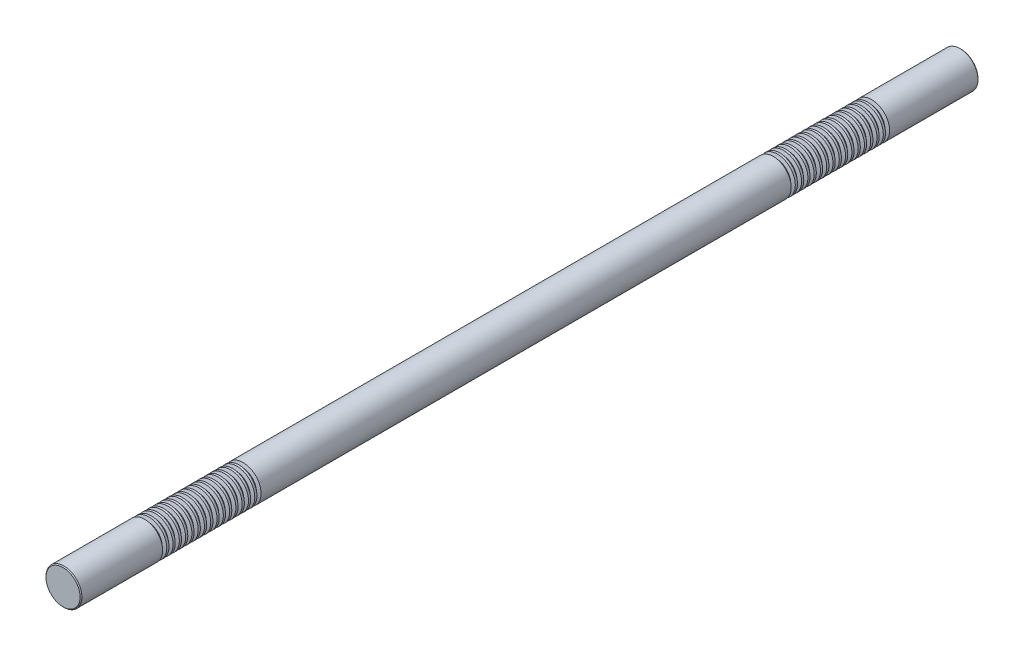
ISO-10303-21;
HEADER;
FILE_DESCRIPTION(('STEP AP214'),'2;1');
FILE_NAME('part.step','',(''),(''),'','','');
FILE_SCHEMA(('AUTOMOTIVE_DESIGN { 1 0 10303 214 1 1 1 1 }'));
ENDSEC;
DATA;
#1=APPLICATION_CONTEXT('core data for automotive mechanical design processes');
#2=APPLICATION_PROTOCOL_DEFINITION('international standard','automotive_design',2000,#1);
#3=PRODUCT_CONTEXT('',#1,'mechanical');
#4=PRODUCT('Part','Part','',(#3));
#5=PRODUCT_RELATED_PRODUCT_CATEGORY('part','',(#4));
#6=PRODUCT_DEFINITION_FORMATION('','',#4);
#7=PRODUCT_DEFINITION_CONTEXT('part definition',#1,'design');
#8=PRODUCT_DEFINITION('design','',#6,#7);
#9=PRODUCT_DEFINITION_SHAPE('','',#8);
#10=(LENGTH_UNIT() NAMED_UNIT(*) SI_UNIT(.MILLI.,.METRE.));
#11=(NAMED_UNIT(*) PLANE_ANGLE_UNIT() SI_UNIT($,.RADIAN.));
#12=(NAMED_UNIT(*) SI_UNIT($,.STERADIAN.) SOLID_ANGLE_UNIT());
#13=UNCERTAINTY_MEASURE_WITH_UNIT(LENGTH_MEASURE(1.E-05),#10,'distance_accuracy_value','');
#14=(GEOMETRIC_REPRESENTATION_CONTEXT(3) GLOBAL_UNCERTAINTY_ASSIGNED_CONTEXT((#13)) GLOBAL_UNIT_ASSIGNED_CONTEXT((#10,
#11,#12)) REPRESENTATION_CONTEXT('',''));
#15=CARTESIAN_POINT('',(0.,0.,0.));
#16=DIRECTION('',(0.,0.,1.));
#17=DIRECTION('',(1.,0.,0.));
#18=AXIS2_PLACEMENT_3D('',#15,#16,#17);
#19=CARTESIAN_POINT('',(0.,0.,500.));
#20=DIRECTION('',(0.,0.,-1.));
#21=DIRECTION('',(-1.,0.,0.));
#22=AXIS2_PLACEMENT_3D('',#19,#20,#21);
#23=CYLINDRICAL_SURFACE('',#22,20.);
#24=CARTESIAN_POINT('',(0.,0.,402.035898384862));
#25=DIRECTION('',(0.,0.,1.));
#26=DIRECTION('',(1.,0.,0.));
#27=AXIS2_PLACEMENT_3D('',#24,#25,#26);
#28=CIRCLE('',#27,20.);
#29=CARTESIAN_POINT('',(20.,0.,402.035898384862));
#30=VERTEX_POINT('',#29);
#31=EDGE_CURVE('E545',#30,#30,#28,.T.);
#32=ORIENTED_EDGE('',*,*,#31,.T.);
#33=EDGE_LOOP('',(#32));
#34=FACE_BOUND('',#33,.T.);
#35=CARTESIAN_POINT('',(0.,0.,404.464101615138));
#36=DIRECTION('',(0.,0.,1.));
#37=DIRECTION('',(1.,0.,0.));
#38=AXIS2_PLACEMENT_3D('',#35,#36,#37);
#39=CIRCLE('',#38,20.);
#40=CARTESIAN_POINT('',(20.,0.,404.464101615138));
#41=VERTEX_POINT('',#40);
#42=EDGE_CURVE('E557',#41,#41,#39,.T.);
#43=ORIENTED_EDGE('',*,*,#42,.F.);
#44=EDGE_LOOP('',(#43));
#45=FACE_BOUND('',#44,.T.);
#46=ADVANCED_FACE('F37',(#34,#45),#23,.T.);
#47=CARTESIAN_POINT('',(0.,0.,395.035898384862));
#48=DIRECTION('',(0.,0.,1.));
#49=DIRECTION('',(1.,0.,0.));
#50=AXIS2_PLACEMENT_3D('',#47,#48,#49);
#51=CIRCLE('',#50,20.);
#52=CARTESIAN_POINT('',(20.,0.,395.035898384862));
#53=VERTEX_POINT('',#52);
#54=EDGE_CURVE('E529',#53,#53,#51,.T.);
#55=ORIENTED_EDGE('',*,*,#54,.T.);
#56=EDGE_LOOP('',(#55));
#57=FACE_BOUND('',#56,.T.);
#58=CARTESIAN_POINT('',(0.,0.,397.464101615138));
#59=DIRECTION('',(0.,0.,1.));
#60=DIRECTION('',(1.,0.,0.));
#61=AXIS2_PLACEMENT_3D('',#58,#59,#60);
#62=CIRCLE('',#61,20.);
#63=CARTESIAN_POINT('',(20.,0.,397.464101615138));
#64=VERTEX_POINT('',#63);
#65=EDGE_CURVE('E541',#64,#64,#62,.T.);
#66=ORIENTED_EDGE('',*,*,#65,.F.);
#67=EDGE_LOOP('',(#66));
#68=FACE_BOUND('',#67,.T.);
#69=ADVANCED_FACE('F593',(#57,#68),#23,.T.);
#70=CARTESIAN_POINT('',(0.,0.,388.035898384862));
#71=DIRECTION('',(0.,0.,1.));
#72=DIRECTION('',(1.,0.,0.));
#73=AXIS2_PLACEMENT_3D('',#70,#71,#72);
#74=CIRCLE('',#73,20.);
#75=CARTESIAN_POINT('',(20.,0.,388.035898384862));
#76=VERTEX_POINT('',#75);
#77=EDGE_CURVE('E513',#76,#76,#74,.T.);
#78=ORIENTED_EDGE('',*,*,#77,.T.);
#79=EDGE_LOOP('',(#78));
#80=FACE_BOUND('',#79,.T.);
#81=CARTESIAN_POINT('',(0.,0.,390.464101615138));
#82=DIRECTION('',(0.,0.,1.));
#83=DIRECTION('',(1.,0.,0.));
#84=AXIS2_PLACEMENT_3D('',#81,#82,#83);
#85=CIRCLE('',#84,20.);
#86=CARTESIAN_POINT('',(20.,0.,390.464101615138));
#87=VERTEX_POINT('',#86);
#88=EDGE_CURVE('E525',#87,#87,#85,.T.);
#89=ORIENTED_EDGE('',*,*,#88,.F.);
#90=EDGE_LOOP('',(#89));
#91=FACE_BOUND('',#90,.T.);
#92=ADVANCED_FACE('F601',(#80,#91),#23,.T.);
#93=CARTESIAN_POINT('',(0.,0.,381.035898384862));
#94=DIRECTION('',(0.,0.,1.));
#95=DIRECTION('',(1.,0.,0.));
#96=AXIS2_PLACEMENT_3D('',#93,#94,#95);
#97=CIRCLE('',#96,20.);
#98=CARTESIAN_POINT('',(20.,0.,381.035898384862));
#99=VERTEX_POINT('',#98);
#100=EDGE_CURVE('E497',#99,#99,#97,.T.);
#101=ORIENTED_EDGE('',*,*,#100,.T.);
#102=EDGE_LOOP('',(#101));
#103=FACE_BOUND('',#102,.T.);
#104=CARTESIAN_POINT('',(0.,0.,383.464101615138));
#105=DIRECTION('',(0.,0.,1.));
#106=DIRECTION('',(1.,0.,0.));
#107=AXIS2_PLACEMENT_3D('',#104,#105,#106);
#108=CIRCLE('',#107,20.);
#109=CARTESIAN_POINT('',(20.,0.,383.464101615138));
#110=VERTEX_POINT('',#109);
#111=EDGE_CURVE('E509',#110,#110,#108,.T.);
#112=ORIENTED_EDGE('',*,*,#111,.F.);
#113=EDGE_LOOP('',(#112));
#114=FACE_BOUND('',#113,.T.);
#115=ADVANCED_FACE('F1238',(#103,#114),#23,.T.);
#116=CARTESIAN_POINT('',(0.,0.,374.035898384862));
#117=DIRECTION('',(0.,0.,1.));
#118=DIRECTION('',(1.,0.,0.));
#119=AXIS2_PLACEMENT_3D('',#116,#117,#118);
#120=CIRCLE('',#119,20.);
#121=CARTESIAN_POINT('',(20.,0.,374.035898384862));
#122=VERTEX_POINT('',#121);
#123=EDGE_CURVE('E481',#122,#122,#120,.T.);
#124=ORIENTED_EDGE('',*,*,#123,.T.);
#125=EDGE_LOOP('',(#124));
#126=FACE_BOUND('',#125,.T.);
#127=CARTESIAN_POINT('',(0.,0.,376.464101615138));
#128=DIRECTION('',(0.,0.,1.));
#129=DIRECTION('',(1.,0.,0.));
#130=AXIS2_PLACEMENT_3D('',#127,#128,#129);
#131=CIRCLE('',#130,20.);
#132=CARTESIAN_POINT('',(20.,0.,376.464101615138));
#133=VERTEX_POINT('',#132);
#134=EDGE_CURVE('E493',#133,#133,#131,.T.);
#135=ORIENTED_EDGE('',*,*,#134,.F.);
#136=EDGE_LOOP('',(#135));
#137=FACE_BOUND('',#136,.T.);
#138=ADVANCED_FACE('F1215',(#126,#137),#23,.T.);
#139=CARTESIAN_POINT('',(0.,0.,367.035898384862));
#140=DIRECTION('',(0.,0.,1.));
#141=DIRECTION('',(1.,0.,0.));
#142=AXIS2_PLACEMENT_3D('',#139,#140,#141);
#143=CIRCLE('',#142,20.);
#144=CARTESIAN_POINT('',(20.,0.,367.035898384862));
#145=VERTEX_POINT('',#144);
#146=EDGE_CURVE('E465',#145,#145,#143,.T.);
#147=ORIENTED_EDGE('',*,*,#146,.T.);
#148=EDGE_LOOP('',(#147));
#149=FACE_BOUND('',#148,.T.);
#150=CARTESIAN_POINT('',(0.,0.,369.464101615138));
#151=DIRECTION('',(0.,0.,1.));
#152=DIRECTION('',(1.,0.,0.));
#153=AXIS2_PLACEMENT_3D('',#150,#151,#152);
#154=CIRCLE('',#153,20.);
#155=CARTESIAN_POINT('',(20.,0.,369.464101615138));
#156=VERTEX_POINT('',#155);
#157=EDGE_CURVE('E477',#156,#156,#154,.T.);
#158=ORIENTED_EDGE('',*,*,#157,.F.);
#159=EDGE_LOOP('',(#158));
#160=FACE_BOUND('',#159,.T.);
#161=ADVANCED_FACE('F1192',(#149,#160),#23,.T.);
#162=CARTESIAN_POINT('',(0.,0.,360.035898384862));
#163=DIRECTION('',(0.,0.,1.));
#164=DIRECTION('',(1.,0.,0.));
#165=AXIS2_PLACEMENT_3D('',#162,#163,#164);
#166=CIRCLE('',#165,20.);
#167=CARTESIAN_POINT('',(20.,0.,360.035898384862));
#168=VERTEX_POINT('',#167);
#169=EDGE_CURVE('E449',#168,#168,#166,.T.);
#170=ORIENTED_EDGE('',*,*,#169,.T.);
#171=EDGE_LOOP('',(#170));
#172=FACE_BOUND('',#171,.T.);
#173=CARTESIAN_POINT('',(0.,0.,362.464101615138));
#174=DIRECTION('',(0.,0.,1.));
#175=DIRECTION('',(1.,0.,0.));
#176=AXIS2_PLACEMENT_3D('',#173,#174,#175);
#177=CIRCLE('',#176,20.);
#178=CARTESIAN_POINT('',(20.,0.,362.464101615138));
#179=VERTEX_POINT('',#178);
#180=EDGE_CURVE('E461',#179,#179,#177,.T.);
#181=ORIENTED_EDGE('',*,*,#180,.F.);
#182=EDGE_LOOP('',(#181));
#183=FACE_BOUND('',#182,.T.);
#184=ADVANCED_FACE('F1169',(#172,#183),#23,.T.);
#185=CARTESIAN_POINT('',(0.,0.,353.035898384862));
#186=DIRECTION('',(0.,0.,1.));
#187=DIRECTION('',(1.,0.,0.));
#188=AXIS2_PLACEMENT_3D('',#185,#186,#187);
#189=CIRCLE('',#188,20.);
#190=CARTESIAN_POINT('',(20.,0.,353.035898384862));
#191=VERTEX_POINT('',#190);
#192=EDGE_CURVE('E433',#191,#191,#189,.T.);
#193=ORIENTED_EDGE('',*,*,#192,.T.);
#194=EDGE_LOOP('',(#193));
#195=FACE_BOUND('',#194,.T.);
#196=CARTESIAN_POINT('',(0.,0.,355.464101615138));
#197=DIRECTION('',(0.,0.,1.));
#198=DIRECTION('',(1.,0.,0.));
#199=AXIS2_PLACEMENT_3D('',#196,#197,#198);
#200=CIRCLE('',#199,20.);
#201=CARTESIAN_POINT('',(20.,0.,355.464101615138));
#202=VERTEX_POINT('',#201);
#203=EDGE_CURVE('E445',#202,#202,#200,.T.);
#204=ORIENTED_EDGE('',*,*,#203,.F.);
#205=EDGE_LOOP('',(#204));
#206=FACE_BOUND('',#205,.T.);
#207=ADVANCED_FACE('F1146',(#195,#206),#23,.T.);
#208=CARTESIAN_POINT('',(0.,0.,346.035898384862));
#209=DIRECTION('',(0.,0.,1.));
#210=DIRECTION('',(1.,0.,0.));
#211=AXIS2_PLACEMENT_3D('',#208,#209,#210);
#212=CIRCLE('',#211,20.);
#213=CARTESIAN_POINT('',(20.,0.,346.035898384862));
#214=VERTEX_POINT('',#213);
#215=EDGE_CURVE('E417',#214,#214,#212,.T.);
#216=ORIENTED_EDGE('',*,*,#215,.T.);
#217=EDGE_LOOP('',(#216));
#218=FACE_BOUND('',#217,.T.);
#219=CARTESIAN_POINT('',(0.,0.,348.464101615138));
#220=DIRECTION('',(0.,0.,1.));
#221=DIRECTION('',(1.,0.,0.));
#222=AXIS2_PLACEMENT_3D('',#219,#220,#221);
#223=CIRCLE('',#222,20.);
#224=CARTESIAN_POINT('',(20.,0.,348.464101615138));
#225=VERTEX_POINT('',#224);
#226=EDGE_CURVE('E429',#225,#225,#223,.T.);
#227=ORIENTED_EDGE('',*,*,#226,.F.);
#228=EDGE_LOOP('',(#227));
#229=FACE_BOUND('',#228,.T.);
#230=ADVANCED_FACE('F1123',(#218,#229),#23,.T.);
#231=CARTESIAN_POINT('',(0.,0.,339.035898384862));
#232=DIRECTION('',(0.,0.,1.));
#233=DIRECTION('',(1.,0.,0.));
#234=AXIS2_PLACEMENT_3D('',#231,#232,#233);
#235=CIRCLE('',#234,20.);
#236=CARTESIAN_POINT('',(20.,0.,339.035898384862));
#237=VERTEX_POINT('',#236);
#238=EDGE_CURVE('E402',#237,#237,#235,.T.);
#239=ORIENTED_EDGE('',*,*,#238,.T.);
#240=EDGE_LOOP('',(#239));
#241=FACE_BOUND('',#240,.T.);
#242=CARTESIAN_POINT('',(0.,0.,341.464101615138));
#243=DIRECTION('',(0.,0.,1.));
#244=DIRECTION('',(1.,0.,0.));
#245=AXIS2_PLACEMENT_3D('',#242,#243,#244);
#246=CIRCLE('',#245,20.);
#247=CARTESIAN_POINT('',(20.,0.,341.464101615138));
#248=VERTEX_POINT('',#247);
#249=EDGE_CURVE('E413',#248,#248,#246,.T.);
#250=ORIENTED_EDGE('',*,*,#249,.F.);
#251=EDGE_LOOP('',(#250));
#252=FACE_BOUND('',#251,.T.);
#253=ADVANCED_FACE('F1100',(#241,#252),#23,.T.);
#254=CARTESIAN_POINT('',(0.,0.,332.035898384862));
#255=DIRECTION('',(0.,0.,1.));
#256=DIRECTION('',(1.,0.,0.));
#257=AXIS2_PLACEMENT_3D('',#254,#255,#256);
#258=CIRCLE('',#257,20.);
#259=CARTESIAN_POINT('',(20.,0.,332.035898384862));
#260=VERTEX_POINT('',#259);
#261=EDGE_CURVE('E386',#260,#260,#258,.T.);
#262=ORIENTED_EDGE('',*,*,#261,.T.);
#263=EDGE_LOOP('',(#262));
#264=FACE_BOUND('',#263,.T.);
#265=CARTESIAN_POINT('',(0.,0.,334.464101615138));
#266=DIRECTION('',(0.,0.,1.));
#267=DIRECTION('',(1.,0.,0.));
#268=AXIS2_PLACEMENT_3D('',#265,#266,#267);
#269=CIRCLE('',#268,20.);
#270=CARTESIAN_POINT('',(20.,0.,334.464101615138));
#271=VERTEX_POINT('',#270);
#272=EDGE_CURVE('E398',#271,#271,#269,.T.);
#273=ORIENTED_EDGE('',*,*,#272,.F.);
#274=EDGE_LOOP('',(#273));
#275=FACE_BOUND('',#274,.T.);
#276=ADVANCED_FACE('F1077',(#264,#275),#23,.T.);
#277=CARTESIAN_POINT('',(0.,0.,325.035898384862));
#278=DIRECTION('',(0.,0.,1.));
#279=DIRECTION('',(1.,0.,0.));
#280=AXIS2_PLACEMENT_3D('',#277,#278,#279);
#281=CIRCLE('',#280,20.);
#282=CARTESIAN_POINT('',(20.,0.,325.035898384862));
#283=VERTEX_POINT('',#282);
#284=EDGE_CURVE('E370',#283,#283,#281,.T.);
#285=ORIENTED_EDGE('',*,*,#284,.T.);
#286=EDGE_LOOP('',(#285));
#287=FACE_BOUND('',#286,.T.);
#288=CARTESIAN_POINT('',(0.,0.,327.464101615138));
#289=DIRECTION('',(0.,0.,1.));
#290=DIRECTION('',(1.,0.,0.));
#291=AXIS2_PLACEMENT_3D('',#288,#289,#290);
#292=CIRCLE('',#291,20.);
#293=CARTESIAN_POINT('',(20.,0.,327.464101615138));
#294=VERTEX_POINT('',#293);
#295=EDGE_CURVE('E382',#294,#294,#292,.T.);
#296=ORIENTED_EDGE('',*,*,#295,.F.);
#297=EDGE_LOOP('',(#296));
#298=FACE_BOUND('',#297,.T.);
#299=ADVANCED_FACE('F1054',(#287,#298),#23,.T.);
#300=CARTESIAN_POINT('',(0.,0.,318.035898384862));
#301=DIRECTION('',(0.,0.,1.));
#302=DIRECTION('',(1.,0.,0.));
#303=AXIS2_PLACEMENT_3D('',#300,#301,#302);
#304=CIRCLE('',#303,20.);
#305=CARTESIAN_POINT('',(20.,0.,318.035898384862));
#306=VERTEX_POINT('',#305);
#307=EDGE_CURVE('E354',#306,#306,#304,.T.);
#308=ORIENTED_EDGE('',*,*,#307,.T.);
#309=EDGE_LOOP('',(#308));
#310=FACE_BOUND('',#309,.T.);
#311=CARTESIAN_POINT('',(0.,0.,320.464101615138));
#312=DIRECTION('',(0.,0.,1.));
#313=DIRECTION('',(1.,0.,0.));
#314=AXIS2_PLACEMENT_3D('',#311,#312,#313);
#315=CIRCLE('',#314,20.);
#316=CARTESIAN_POINT('',(20.,0.,320.464101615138));
#317=VERTEX_POINT('',#316);
#318=EDGE_CURVE('E366',#317,#317,#315,.T.);
#319=ORIENTED_EDGE('',*,*,#318,.F.);
#320=EDGE_LOOP('',(#319));
#321=FACE_BOUND('',#320,.T.);
#322=ADVANCED_FACE('F1031',(#310,#321),#23,.T.);
#323=CARTESIAN_POINT('',(0.,0.,311.035898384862));
#324=DIRECTION('',(0.,0.,1.));
#325=DIRECTION('',(1.,0.,0.));
#326=AXIS2_PLACEMENT_3D('',#323,#324,#325);
#327=CIRCLE('',#326,20.);
#328=CARTESIAN_POINT('',(20.,0.,311.035898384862));
#329=VERTEX_POINT('',#328);
#330=EDGE_CURVE('E338',#329,#329,#327,.T.);
#331=ORIENTED_EDGE('',*,*,#330,.T.);
#332=EDGE_LOOP('',(#331));
#333=FACE_BOUND('',#332,.T.);
#334=CARTESIAN_POINT('',(0.,0.,313.464101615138));
#335=DIRECTION('',(0.,0.,1.));
#336=DIRECTION('',(1.,0.,0.));
#337=AXIS2_PLACEMENT_3D('',#334,#335,#336);
#338=CIRCLE('',#337,20.);
#339=CARTESIAN_POINT('',(20.,0.,313.464101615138));
#340=VERTEX_POINT('',#339);
#341=EDGE_CURVE('E350',#340,#340,#338,.T.);
#342=ORIENTED_EDGE('',*,*,#341,.F.);
#343=EDGE_LOOP('',(#342));
#344=FACE_BOUND('',#343,.T.);
#345=ADVANCED_FACE('F1008',(#333,#344),#23,.T.);
#346=CARTESIAN_POINT('',(0.,0.,304.035898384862));
#347=DIRECTION('',(0.,0.,1.));
#348=DIRECTION('',(1.,0.,0.));
#349=AXIS2_PLACEMENT_3D('',#346,#347,#348);
#350=CIRCLE('',#349,20.);
#351=CARTESIAN_POINT('',(20.,0.,304.035898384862));
#352=VERTEX_POINT('',#351);
#353=EDGE_CURVE('E323',#352,#352,#350,.T.);
#354=ORIENTED_EDGE('',*,*,#353,.T.);
#355=EDGE_LOOP('',(#354));
#356=FACE_BOUND('',#355,.T.);
#357=CARTESIAN_POINT('',(0.,0.,306.464101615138));
#358=DIRECTION('',(0.,0.,1.));
#359=DIRECTION('',(1.,0.,0.));
#360=AXIS2_PLACEMENT_3D('',#357,#358,#359);
#361=CIRCLE('',#360,20.);
#362=CARTESIAN_POINT('',(20.,0.,306.464101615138));
#363=VERTEX_POINT('',#362);
#364=EDGE_CURVE('E334',#363,#363,#361,.T.);
#365=ORIENTED_EDGE('',*,*,#364,.F.);
#366=EDGE_LOOP('',(#365));
#367=FACE_BOUND('',#366,.T.);
#368=ADVANCED_FACE('F985',(#356,#367),#23,.T.);
#369=CARTESIAN_POINT('',(0.,0.,-290.964101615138));
#370=DIRECTION('',(0.,0.,1.));
#371=DIRECTION('',(1.,0.,0.));
#372=AXIS2_PLACEMENT_3D('',#369,#370,#371);
#373=CIRCLE('',#372,20.);
#374=CARTESIAN_POINT('',(20.,0.,-290.964101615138));
#375=VERTEX_POINT('',#374);
#376=EDGE_CURVE('E307',#375,#375,#373,.T.);
#377=ORIENTED_EDGE('',*,*,#376,.T.);
#378=EDGE_LOOP('',(#377));
#379=FACE_BOUND('',#378,.T.);
#380=CARTESIAN_POINT('',(0.,0.,299.464101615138));
#381=DIRECTION('',(0.,0.,1.));
#382=DIRECTION('',(1.,0.,0.));
#383=AXIS2_PLACEMENT_3D('',#380,#381,#382);
#384=CIRCLE('',#383,20.);
#385=CARTESIAN_POINT('',(20.,0.,299.464101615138));
#386=VERTEX_POINT('',#385);
#387=EDGE_CURVE('E319',#386,#386,#384,.T.);
#388=ORIENTED_EDGE('',*,*,#387,.F.);
#389=EDGE_LOOP('',(#388));
#390=FACE_BOUND('',#389,.T.);
#391=ADVANCED_FACE('F962',(#379,#390),#23,.T.);
#392=CARTESIAN_POINT('',(0.,0.,-297.964101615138));
#393=DIRECTION('',(0.,0.,1.));
#394=DIRECTION('',(1.,0.,0.));
#395=AXIS2_PLACEMENT_3D('',#392,#393,#394);
#396=CIRCLE('',#395,20.);
#397=CARTESIAN_POINT('',(20.,0.,-297.964101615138));
#398=VERTEX_POINT('',#397);
#399=EDGE_CURVE('E291',#398,#398,#396,.T.);
#400=ORIENTED_EDGE('',*,*,#399,.T.);
#401=EDGE_LOOP('',(#400));
#402=FACE_BOUND('',#401,.T.);
#403=CARTESIAN_POINT('',(0.,0.,-295.535898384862));
#404=DIRECTION('',(0.,0.,1.));
#405=DIRECTION('',(1.,0.,0.));
#406=AXIS2_PLACEMENT_3D('',#403,#404,#405);
#407=CIRCLE('',#406,20.);
#408=CARTESIAN_POINT('',(20.,0.,-295.535898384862));
#409=VERTEX_POINT('',#408);
#410=EDGE_CURVE('E303',#409,#409,#407,.T.);
#411=ORIENTED_EDGE('',*,*,#410,.F.);
#412=EDGE_LOOP('',(#411));
#413=FACE_BOUND('',#412,.T.);
#414=ADVANCED_FACE('F939',(#402,#413),#23,.T.);
#415=CARTESIAN_POINT('',(0.,0.,-304.964101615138));
#416=DIRECTION('',(0.,0.,1.));
#417=DIRECTION('',(1.,0.,0.));
#418=AXIS2_PLACEMENT_3D('',#415,#416,#417);
#419=CIRCLE('',#418,20.);
#420=CARTESIAN_POINT('',(20.,0.,-304.964101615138));
#421=VERTEX_POINT('',#420);
#422=EDGE_CURVE('E275',#421,#421,#419,.T.);
#423=ORIENTED_EDGE('',*,*,#422,.T.);
#424=EDGE_LOOP('',(#423));
#425=FACE_BOUND('',#424,.T.);
#426=CARTESIAN_POINT('',(0.,0.,-302.535898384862));
#427=DIRECTION('',(0.,0.,1.));
#428=DIRECTION('',(1.,0.,0.));
#429=AXIS2_PLACEMENT_3D('',#426,#427,#428);
#430=CIRCLE('',#429,20.);
#431=CARTESIAN_POINT('',(20.,0.,-302.535898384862));
#432=VERTEX_POINT('',#431);
#433=EDGE_CURVE('E287',#432,#432,#430,.T.);
#434=ORIENTED_EDGE('',*,*,#433,.F.);
#435=EDGE_LOOP('',(#434));
#436=FACE_BOUND('',#435,.T.);
#437=ADVANCED_FACE('F916',(#425,#436),#23,.T.);
#438=CARTESIAN_POINT('',(0.,0.,-311.964101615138));
#439=DIRECTION('',(0.,0.,1.));
#440=DIRECTION('',(1.,0.,0.));
#441=AXIS2_PLACEMENT_3D('',#438,#439,#440);
#442=CIRCLE('',#441,20.);
#443=CARTESIAN_POINT('',(20.,0.,-311.964101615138));
#444=VERTEX_POINT('',#443);
#445=EDGE_CURVE('E259',#444,#444,#442,.T.);
#446=ORIENTED_EDGE('',*,*,#445,.T.);
#447=EDGE_LOOP('',(#446));
#448=FACE_BOUND('',#447,.T.);
#449=CARTESIAN_POINT('',(0.,0.,-309.535898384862));
#450=DIRECTION('',(0.,0.,1.));
#451=DIRECTION('',(1.,0.,0.));
#452=AXIS2_PLACEMENT_3D('',#449,#450,#451);
#453=CIRCLE('',#452,20.);
#454=CARTESIAN_POINT('',(20.,0.,-309.535898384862));
#455=VERTEX_POINT('',#454);
#456=EDGE_CURVE('E271',#455,#455,#453,.T.);
#457=ORIENTED_EDGE('',*,*,#456,.F.);
#458=EDGE_LOOP('',(#457));
#459=FACE_BOUND('',#458,.T.);
#460=ADVANCED_FACE('F893',(#448,#459),#23,.T.);
#461=CARTESIAN_POINT('',(0.,0.,-318.964101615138));
#462=DIRECTION('',(0.,0.,1.));
#463=DIRECTION('',(1.,0.,0.));
#464=AXIS2_PLACEMENT_3D('',#461,#462,#463);
#465=CIRCLE('',#464,20.);
#466=CARTESIAN_POINT('',(20.,0.,-318.964101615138));
#467=VERTEX_POINT('',#466);
#468=EDGE_CURVE('E243',#467,#467,#465,.T.);
#469=ORIENTED_EDGE('',*,*,#468,.T.);
#470=EDGE_LOOP('',(#469));
#471=FACE_BOUND('',#470,.T.);
#472=CARTESIAN_POINT('',(0.,0.,-316.535898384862));
#473=DIRECTION('',(0.,0.,1.));
#474=DIRECTION('',(1.,0.,0.));
#475=AXIS2_PLACEMENT_3D('',#472,#473,#474);
#476=CIRCLE('',#475,20.);
#477=CARTESIAN_POINT('',(20.,0.,-316.535898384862));
#478=VERTEX_POINT('',#477);
#479=EDGE_CURVE('E255',#478,#478,#476,.T.);
#480=ORIENTED_EDGE('',*,*,#479,.F.);
#481=EDGE_LOOP('',(#480));
#482=FACE_BOUND('',#481,.T.);
#483=ADVANCED_FACE('F870',(#471,#482),#23,.T.);
#484=CARTESIAN_POINT('',(0.,0.,-325.964101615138));
#485=DIRECTION('',(0.,0.,1.));
#486=DIRECTION('',(1.,0.,0.));
#487=AXIS2_PLACEMENT_3D('',#484,#485,#486);
#488=CIRCLE('',#487,20.);
#489=CARTESIAN_POINT('',(20.,0.,-325.964101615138));
#490=VERTEX_POINT('',#489);
#491=EDGE_CURVE('E227',#490,#490,#488,.T.);
#492=ORIENTED_EDGE('',*,*,#491,.T.);
#493=EDGE_LOOP('',(#492));
#494=FACE_BOUND('',#493,.T.);
#495=CARTESIAN_POINT('',(0.,0.,-323.535898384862));
#496=DIRECTION('',(0.,0.,1.));
#497=DIRECTION('',(1.,0.,0.));
#498=AXIS2_PLACEMENT_3D('',#495,#496,#497);
#499=CIRCLE('',#498,20.);
#500=CARTESIAN_POINT('',(20.,0.,-323.535898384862));
#501=VERTEX_POINT('',#500);
#502=EDGE_CURVE('E239',#501,#501,#499,.T.);
#503=ORIENTED_EDGE('',*,*,#502,.F.);
#504=EDGE_LOOP('',(#503));
#505=FACE_BOUND('',#504,.T.);
#506=ADVANCED_FACE('F847',(#494,#505),#23,.T.);
#507=CARTESIAN_POINT('',(0.,0.,-332.964101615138));
#508=DIRECTION('',(0.,0.,1.));
#509=DIRECTION('',(1.,0.,0.));
#510=AXIS2_PLACEMENT_3D('',#507,#508,#509);
#511=CIRCLE('',#510,20.);
#512=CARTESIAN_POINT('',(20.,0.,-332.964101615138));
#513=VERTEX_POINT('',#512);
#514=EDGE_CURVE('E211',#513,#513,#511,.T.);
#515=ORIENTED_EDGE('',*,*,#514,.T.);
#516=EDGE_LOOP('',(#515));
#517=FACE_BOUND('',#516,.T.);
#518=CARTESIAN_POINT('',(0.,0.,-330.535898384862));
#519=DIRECTION('',(0.,0.,1.));
#520=DIRECTION('',(1.,0.,0.));
#521=AXIS2_PLACEMENT_3D('',#518,#519,#520);
#522=CIRCLE('',#521,20.);
#523=CARTESIAN_POINT('',(20.,0.,-330.535898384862));
#524=VERTEX_POINT('',#523);
#525=EDGE_CURVE('E223',#524,#524,#522,.T.);
#526=ORIENTED_EDGE('',*,*,#525,.F.);
#527=EDGE_LOOP('',(#526));
#528=FACE_BOUND('',#527,.T.);
#529=ADVANCED_FACE('F824',(#517,#528),#23,.T.);
#530=CARTESIAN_POINT('',(0.,0.,-339.964101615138));
#531=DIRECTION('',(0.,0.,1.));
#532=DIRECTION('',(1.,0.,0.));
#533=AXIS2_PLACEMENT_3D('',#530,#531,#532);
#534=CIRCLE('',#533,20.);
#535=CARTESIAN_POINT('',(20.,0.,-339.964101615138));
#536=VERTEX_POINT('',#535);
#537=EDGE_CURVE('E195',#536,#536,#534,.T.);
#538=ORIENTED_EDGE('',*,*,#537,.T.);
#539=EDGE_LOOP('',(#538));
#540=FACE_BOUND('',#539,.T.);
#541=CARTESIAN_POINT('',(0.,0.,-337.535898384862));
#542=DIRECTION('',(0.,0.,1.));
#543=DIRECTION('',(1.,0.,0.));
#544=AXIS2_PLACEMENT_3D('',#541,#542,#543);
#545=CIRCLE('',#544,20.);
#546=CARTESIAN_POINT('',(20.,0.,-337.535898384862));
#547=VERTEX_POINT('',#546);
#548=EDGE_CURVE('E207',#547,#547,#545,.T.);
#549=ORIENTED_EDGE('',*,*,#548,.F.);
#550=EDGE_LOOP('',(#549));
#551=FACE_BOUND('',#550,.T.);
#552=ADVANCED_FACE('F801',(#540,#551),#23,.T.);
#553=CARTESIAN_POINT('',(0.,0.,-346.964101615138));
#554=DIRECTION('',(0.,0.,1.));
#555=DIRECTION('',(1.,0.,0.));
#556=AXIS2_PLACEMENT_3D('',#553,#554,#555);
#557=CIRCLE('',#556,20.);
#558=CARTESIAN_POINT('',(20.,0.,-346.964101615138));
#559=VERTEX_POINT('',#558);
#560=EDGE_CURVE('E179',#559,#559,#557,.T.);
#561=ORIENTED_EDGE('',*,*,#560,.T.);
#562=EDGE_LOOP('',(#561));
#563=FACE_BOUND('',#562,.T.);
#564=CARTESIAN_POINT('',(0.,0.,-344.535898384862));
#565=DIRECTION('',(0.,0.,1.));
#566=DIRECTION('',(1.,0.,0.));
#567=AXIS2_PLACEMENT_3D('',#564,#565,#566);
#568=CIRCLE('',#567,20.);
#569=CARTESIAN_POINT('',(20.,0.,-344.535898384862));
#570=VERTEX_POINT('',#569);
#571=EDGE_CURVE('E191',#570,#570,#568,.T.);
#572=ORIENTED_EDGE('',*,*,#571,.F.);
#573=EDGE_LOOP('',(#572));
#574=FACE_BOUND('',#573,.T.);
#575=ADVANCED_FACE('F778',(#563,#574),#23,.T.);
#576=CARTESIAN_POINT('',(0.,0.,-353.964101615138));
#577=DIRECTION('',(0.,0.,1.));
#578=DIRECTION('',(1.,0.,0.));
#579=AXIS2_PLACEMENT_3D('',#576,#577,#578);
#580=CIRCLE('',#579,20.);
#581=CARTESIAN_POINT('',(20.,0.,-353.964101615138));
#582=VERTEX_POINT('',#581);
#583=EDGE_CURVE('E163',#582,#582,#580,.T.);
#584=ORIENTED_EDGE('',*,*,#583,.T.);
#585=EDGE_LOOP('',(#584));
#586=FACE_BOUND('',#585,.T.);
#587=CARTESIAN_POINT('',(0.,0.,-351.535898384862));
#588=DIRECTION('',(0.,0.,1.));
#589=DIRECTION('',(1.,0.,0.));
#590=AXIS2_PLACEMENT_3D('',#587,#588,#589);
#591=CIRCLE('',#590,20.);
#592=CARTESIAN_POINT('',(20.,0.,-351.535898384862));
#593=VERTEX_POINT('',#592);
#594=EDGE_CURVE('E175',#593,#593,#591,.T.);
#595=ORIENTED_EDGE('',*,*,#594,.F.);
#596=EDGE_LOOP('',(#595));
#597=FACE_BOUND('',#596,.T.);
#598=ADVANCED_FACE('F755',(#586,#597),#23,.T.);
#599=CARTESIAN_POINT('',(0.,0.,-360.964101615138));
#600=DIRECTION('',(0.,0.,1.));
#601=DIRECTION('',(1.,0.,0.));
#602=AXIS2_PLACEMENT_3D('',#599,#600,#601);
#603=CIRCLE('',#602,20.);
#604=CARTESIAN_POINT('',(20.,0.,-360.964101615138));
#605=VERTEX_POINT('',#604);
#606=EDGE_CURVE('E147',#605,#605,#603,.T.);
#607=ORIENTED_EDGE('',*,*,#606,.T.);
#608=EDGE_LOOP('',(#607));
#609=FACE_BOUND('',#608,.T.);
#610=CARTESIAN_POINT('',(0.,0.,-358.535898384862));
#611=DIRECTION('',(0.,0.,1.));
#612=DIRECTION('',(1.,0.,0.));
#613=AXIS2_PLACEMENT_3D('',#610,#611,#612);
#614=CIRCLE('',#613,20.);
#615=CARTESIAN_POINT('',(20.,0.,-358.535898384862));
#616=VERTEX_POINT('',#615);
#617=EDGE_CURVE('E159',#616,#616,#614,.T.);
#618=ORIENTED_EDGE('',*,*,#617,.F.);
#619=EDGE_LOOP('',(#618));
#620=FACE_BOUND('',#619,.T.);
#621=ADVANCED_FACE('F732',(#609,#620),#23,.T.);
#622=CARTESIAN_POINT('',(0.,0.,-367.964101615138));
#623=DIRECTION('',(0.,0.,1.));
#624=DIRECTION('',(1.,0.,0.));
#625=AXIS2_PLACEMENT_3D('',#622,#623,#624);
#626=CIRCLE('',#625,20.);
#627=CARTESIAN_POINT('',(20.,0.,-367.964101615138));
#628=VERTEX_POINT('',#627);
#629=EDGE_CURVE('E131',#628,#628,#626,.T.);
#630=ORIENTED_EDGE('',*,*,#629,.T.);
#631=EDGE_LOOP('',(#630));
#632=FACE_BOUND('',#631,.T.);
#633=CARTESIAN_POINT('',(0.,0.,-365.535898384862));
#634=DIRECTION('',(0.,0.,1.));
#635=DIRECTION('',(1.,0.,0.));
#636=AXIS2_PLACEMENT_3D('',#633,#634,#635);
#637=CIRCLE('',#636,20.);
#638=CARTESIAN_POINT('',(20.,0.,-365.535898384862));
#639=VERTEX_POINT('',#638);
#640=EDGE_CURVE('E143',#639,#639,#637,.T.);
#641=ORIENTED_EDGE('',*,*,#640,.F.);
#642=EDGE_LOOP('',(#641));
#643=FACE_BOUND('',#642,.T.);
#644=ADVANCED_FACE('F709',(#632,#643),#23,.T.);
#645=CARTESIAN_POINT('',(0.,0.,-374.964101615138));
#646=DIRECTION('',(0.,0.,1.));
#647=DIRECTION('',(1.,0.,0.));
#648=AXIS2_PLACEMENT_3D('',#645,#646,#647);
#649=CIRCLE('',#648,20.);
#650=CARTESIAN_POINT('',(20.,0.,-374.964101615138));
#651=VERTEX_POINT('',#650);
#652=EDGE_CURVE('E116',#651,#651,#649,.T.);
#653=ORIENTED_EDGE('',*,*,#652,.T.);
#654=EDGE_LOOP('',(#653));
#655=FACE_BOUND('',#654,.T.);
#656=CARTESIAN_POINT('',(0.,0.,-372.535898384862));
#657=DIRECTION('',(0.,0.,1.));
#658=DIRECTION('',(1.,0.,0.));
#659=AXIS2_PLACEMENT_3D('',#656,#657,#658);
#660=CIRCLE('',#659,20.);
#661=CARTESIAN_POINT('',(20.,0.,-372.535898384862));
#662=VERTEX_POINT('',#661);
#663=EDGE_CURVE('E127',#662,#662,#660,.T.);
#664=ORIENTED_EDGE('',*,*,#663,.F.);
#665=EDGE_LOOP('',(#664));
#666=FACE_BOUND('',#665,.T.);
#667=ADVANCED_FACE('F686',(#655,#666),#23,.T.);
#668=CARTESIAN_POINT('',(0.,0.,-381.964101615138));
#669=DIRECTION('',(0.,0.,1.));
#670=DIRECTION('',(1.,0.,0.));
#671=AXIS2_PLACEMENT_3D('',#668,#669,#670);
#672=CIRCLE('',#671,20.);
#673=CARTESIAN_POINT('',(20.,0.,-381.964101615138));
#674=VERTEX_POINT('',#673);
#675=EDGE_CURVE('E101',#674,#674,#672,.T.);
#676=ORIENTED_EDGE('',*,*,#675,.T.);
#677=EDGE_LOOP('',(#676));
#678=FACE_BOUND('',#677,.T.);
#679=CARTESIAN_POINT('',(0.,0.,-379.535898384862));
#680=DIRECTION('',(0.,0.,1.));
#681=DIRECTION('',(1.,0.,0.));
#682=AXIS2_PLACEMENT_3D('',#679,#680,#681);
#683=CIRCLE('',#682,20.);
#684=CARTESIAN_POINT('',(20.,0.,-379.535898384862));
#685=VERTEX_POINT('',#684);
#686=EDGE_CURVE('E112',#685,#685,#683,.T.);
#687=ORIENTED_EDGE('',*,*,#686,.F.);
#688=EDGE_LOOP('',(#687));
#689=FACE_BOUND('',#688,.T.);
#690=ADVANCED_FACE('F663',(#678,#689),#23,.T.);
#691=CARTESIAN_POINT('',(0.,0.,-388.964101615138));
#692=DIRECTION('',(0.,0.,1.));
#693=DIRECTION('',(1.,0.,0.));
#694=AXIS2_PLACEMENT_3D('',#691,#692,#693);
#695=CIRCLE('',#694,20.);
#696=CARTESIAN_POINT('',(20.,0.,-388.964101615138));
#697=VERTEX_POINT('',#696);
#698=EDGE_CURVE('E85',#697,#697,#695,.T.);
#699=ORIENTED_EDGE('',*,*,#698,.T.);
#700=EDGE_LOOP('',(#699));
#701=FACE_BOUND('',#700,.T.);
#702=CARTESIAN_POINT('',(0.,0.,-386.535898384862));
#703=DIRECTION('',(0.,0.,1.));
#704=DIRECTION('',(1.,0.,0.));
#705=AXIS2_PLACEMENT_3D('',#702,#703,#704);
#706=CIRCLE('',#705,20.);
#707=CARTESIAN_POINT('',(20.,0.,-386.535898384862));
#708=VERTEX_POINT('',#707);
#709=EDGE_CURVE('E97',#708,#708,#706,.T.);
#710=ORIENTED_EDGE('',*,*,#709,.F.);
#711=EDGE_LOOP('',(#710));
#712=FACE_BOUND('',#711,.T.);
#713=ADVANCED_FACE('F616',(#701,#712),#23,.T.);
#714=CARTESIAN_POINT('',(0.,0.,-395.964101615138));
#715=DIRECTION('',(0.,0.,1.));
#716=DIRECTION('',(1.,0.,0.));
#717=AXIS2_PLACEMENT_3D('',#714,#715,#716);
#718=CIRCLE('',#717,20.);
#719=CARTESIAN_POINT('',(20.,0.,-395.964101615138));
#720=VERTEX_POINT('',#719);
#721=EDGE_CURVE('E69',#720,#720,#718,.T.);
#722=ORIENTED_EDGE('',*,*,#721,.T.);
#723=EDGE_LOOP('',(#722));
#724=FACE_BOUND('',#723,.T.);
#725=CARTESIAN_POINT('',(0.,0.,-393.535898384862));
#726=DIRECTION('',(0.,0.,1.));
#727=DIRECTION('',(1.,0.,0.));
#728=AXIS2_PLACEMENT_3D('',#725,#726,#727);
#729=CIRCLE('',#728,20.);
#730=CARTESIAN_POINT('',(20.,0.,-393.535898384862));
#731=VERTEX_POINT('',#730);
#732=EDGE_CURVE('E81',#731,#731,#729,.T.);
#733=ORIENTED_EDGE('',*,*,#732,.F.);
#734=EDGE_LOOP('',(#733));
#735=FACE_BOUND('',#734,.T.);
#736=ADVANCED_FACE('F609',(#724,#735),#23,.T.);
#737=CARTESIAN_POINT('',(0.,0.,-499.));
#738=DIRECTION('',(0.,0.,1.));
#739=DIRECTION('',(1.,0.,0.));
#740=AXIS2_PLACEMENT_3D('',#737,#738,#739);
#741=CIRCLE('',#740,20.);
#742=CARTESIAN_POINT('',(20.,0.,-499.));
#743=VERTEX_POINT('',#742);
#744=EDGE_CURVE('E52',#743,#743,#741,.T.);
#745=ORIENTED_EDGE('',*,*,#744,.T.);
#746=EDGE_LOOP('',(#745));
#747=FACE_BOUND('',#746,.T.);
#748=CARTESIAN_POINT('',(0.,0.,-400.535898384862));
#749=DIRECTION('',(0.,0.,1.));
#750=DIRECTION('',(1.,0.,0.));
#751=AXIS2_PLACEMENT_3D('',#748,#749,#750);
#752=CIRCLE('',#751,20.);
#753=CARTESIAN_POINT('',(20.,0.,-400.535898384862));
#754=VERTEX_POINT('',#753);
#755=EDGE_CURVE('E65',#754,#754,#752,.T.);
#756=ORIENTED_EDGE('',*,*,#755,.F.);
#757=EDGE_LOOP('',(#756));
#758=FACE_BOUND('',#757,.T.);
#759=ADVANCED_FACE('F597',(#747,#758),#23,.T.);
#760=CARTESIAN_POINT('',(0.,0.,-500.));
#761=DIRECTION('',(0.,0.,1.));
#762=DIRECTION('',(1.,0.,0.));
#763=AXIS2_PLACEMENT_3D('',#760,#761,#762);
#764=PLANE('',#763);
#765=CARTESIAN_POINT('',(0.,0.,-500.));
#766=DIRECTION('',(0.,0.,1.));
#767=DIRECTION('',(1.,0.,0.));
#768=AXIS2_PLACEMENT_3D('',#765,#766,#767);
#769=CIRCLE('',#768,18.9999999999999);
#770=CARTESIAN_POINT('',(18.9999999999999,0.,-500.));
#771=VERTEX_POINT('',#770);
#772=EDGE_CURVE('E45',#771,#771,#769,.F.);
#773=ORIENTED_EDGE('',*,*,#772,.T.);
#774=EDGE_LOOP('',(#773));
#775=FACE_BOUND('',#774,.T.);
#776=ADVANCED_FACE('F608',(#775),#764,.F.);
#777=CARTESIAN_POINT('',(0.,0.,-499.));
#778=DIRECTION('',(0.,0.,1.));
#779=DIRECTION('',(1.,0.,0.));
#780=AXIS2_PLACEMENT_3D('',#777,#778,#779);
#781=CONICAL_SURFACE('',#780,20.,0.78539816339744);
#782=ORIENTED_EDGE('',*,*,#772,.F.);
#783=EDGE_LOOP('',(#782));
#784=FACE_BOUND('',#783,.T.);
#785=ORIENTED_EDGE('',*,*,#744,.F.);
#786=EDGE_LOOP('',(#785));
#787=FACE_BOUND('',#786,.T.);
#788=ADVANCED_FACE('F615',(#784,#787),#781,.T.);
#789=CARTESIAN_POINT('',(0.,0.,-399.464101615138));
#790=DIRECTION('',(0.,0.,-1.));
#791=DIRECTION('',(-1.,0.,0.));
#792=AXIS2_PLACEMENT_3D('',#789,#790,#791);
#793=CONICAL_SURFACE('',#792,16.,1.30899693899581);
#794=ORIENTED_EDGE('',*,*,#755,.T.);
#795=EDGE_LOOP('',(#794));
#796=FACE_BOUND('',#795,.T.);
#797=CARTESIAN_POINT('',(0.,0.,-399.464101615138));
#798=DIRECTION('',(0.,0.,1.));
#799=DIRECTION('',(1.,0.,0.));
#800=AXIS2_PLACEMENT_3D('',#797,#798,#799);
#801=CIRCLE('',#800,16.);
#802=CARTESIAN_POINT('',(16.,0.,-399.464101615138));
#803=VERTEX_POINT('',#802);
#804=EDGE_CURVE('E77',#803,#803,#801,.T.);
#805=ORIENTED_EDGE('',*,*,#804,.F.);
#806=EDGE_LOOP('',(#805));
#807=FACE_BOUND('',#806,.T.);
#808=ADVANCED_FACE('F622',(#796,#807),#793,.T.);
#809=CARTESIAN_POINT('',(0.,0.,-395.964101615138));
#810=DIRECTION('',(0.,0.,1.));
#811=DIRECTION('',(1.,0.,0.));
#812=AXIS2_PLACEMENT_3D('',#809,#810,#811);
#813=CONICAL_SURFACE('',#812,20.,1.30899693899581);
#814=CARTESIAN_POINT('',(0.,0.,-397.035898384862));
#815=DIRECTION('',(0.,0.,1.));
#816=DIRECTION('',(1.,0.,0.));
#817=AXIS2_PLACEMENT_3D('',#814,#815,#816);
#818=CIRCLE('',#817,16.);
#819=CARTESIAN_POINT('',(16.,0.,-397.035898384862));
#820=VERTEX_POINT('',#819);
#821=EDGE_CURVE('E73',#820,#820,#818,.T.);
#822=ORIENTED_EDGE('',*,*,#821,.T.);
#823=EDGE_LOOP('',(#822));
#824=FACE_BOUND('',#823,.T.);
#825=ORIENTED_EDGE('',*,*,#721,.F.);
#826=EDGE_LOOP('',(#825));
#827=FACE_BOUND('',#826,.T.);
#828=ADVANCED_FACE('F625',(#824,#827),#813,.T.);
#829=CARTESIAN_POINT('',(0.,0.,499.));
#830=DIRECTION('',(0.,0.,1.));
#831=DIRECTION('',(1.,0.,0.));
#832=AXIS2_PLACEMENT_3D('',#829,#830,#831);
#833=CYLINDRICAL_SURFACE('',#832,16.);
#834=ORIENTED_EDGE('',*,*,#804,.T.);
#835=EDGE_LOOP('',(#834));
#836=FACE_BOUND('',#835,.T.);
#837=ORIENTED_EDGE('',*,*,#821,.F.);
#838=EDGE_LOOP('',(#837));
#839=FACE_BOUND('',#838,.T.);
#840=ADVANCED_FACE('F629',(#836,#839),#833,.T.);
#841=CARTESIAN_POINT('',(0.,0.,-392.464101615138));
#842=DIRECTION('',(0.,0.,-1.));
#843=DIRECTION('',(-1.,0.,0.));
#844=AXIS2_PLACEMENT_3D('',#841,#842,#843);
#845=CONICAL_SURFACE('',#844,16.,1.30899693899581);
#846=ORIENTED_EDGE('',*,*,#732,.T.);
#847=EDGE_LOOP('',(#846));
#848=FACE_BOUND('',#847,.T.);
#849=CARTESIAN_POINT('',(0.,0.,-392.464101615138));
#850=DIRECTION('',(0.,0.,1.));
#851=DIRECTION('',(1.,0.,0.));
#852=AXIS2_PLACEMENT_3D('',#849,#850,#851);
#853=CIRCLE('',#852,16.);
#854=CARTESIAN_POINT('',(16.,0.,-392.464101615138));
#855=VERTEX_POINT('',#854);
#856=EDGE_CURVE('E93',#855,#855,#853,.T.);
#857=ORIENTED_EDGE('',*,*,#856,.F.);
#858=EDGE_LOOP('',(#857));
#859=FACE_BOUND('',#858,.T.);
#860=ADVANCED_FACE('F632',(#848,#859),#845,.T.);
#861=CARTESIAN_POINT('',(0.,0.,-388.964101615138));
#862=DIRECTION('',(0.,0.,1.));
#863=DIRECTION('',(1.,0.,0.));
#864=AXIS2_PLACEMENT_3D('',#861,#862,#863);
#865=CONICAL_SURFACE('',#864,20.,1.30899693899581);
#866=CARTESIAN_POINT('',(0.,0.,-390.035898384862));
#867=DIRECTION('',(0.,0.,1.));
#868=DIRECTION('',(1.,0.,0.));
#869=AXIS2_PLACEMENT_3D('',#866,#867,#868);
#870=CIRCLE('',#869,16.);
#871=CARTESIAN_POINT('',(16.,0.,-390.035898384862));
#872=VERTEX_POINT('',#871);
#873=EDGE_CURVE('E89',#872,#872,#870,.T.);
#874=ORIENTED_EDGE('',*,*,#873,.T.);
#875=EDGE_LOOP('',(#874));
#876=FACE_BOUND('',#875,.T.);
#877=ORIENTED_EDGE('',*,*,#698,.F.);
#878=EDGE_LOOP('',(#877));
#879=FACE_BOUND('',#878,.T.);
#880=ADVANCED_FACE('F645',(#876,#879),#865,.T.);
#881=CARTESIAN_POINT('',(0.,0.,-393.535898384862));
#882=DIRECTION('',(0.,0.,1.));
#883=DIRECTION('',(1.,0.,0.));
#884=AXIS2_PLACEMENT_3D('',#881,#882,#883);
#885=CYLINDRICAL_SURFACE('',#884,16.);
#886=ORIENTED_EDGE('',*,*,#856,.T.);
#887=EDGE_LOOP('',(#886));
#888=FACE_BOUND('',#887,.T.);
#889=ORIENTED_EDGE('',*,*,#873,.F.);
#890=EDGE_LOOP('',(#889));
#891=FACE_BOUND('',#890,.T.);
#892=ADVANCED_FACE('F649',(#888,#891),#885,.T.);
#893=CARTESIAN_POINT('',(0.,0.,-385.464101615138));
#894=DIRECTION('',(0.,0.,-1.));
#895=DIRECTION('',(-1.,0.,0.));
#896=AXIS2_PLACEMENT_3D('',#893,#894,#895);
#897=CONICAL_SURFACE('',#896,16.,1.30899693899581);
#898=ORIENTED_EDGE('',*,*,#709,.T.);
#899=EDGE_LOOP('',(#898));
#900=FACE_BOUND('',#899,.T.);
#901=CARTESIAN_POINT('',(0.,0.,-385.464101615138));
#902=DIRECTION('',(0.,0.,1.));
#903=DIRECTION('',(1.,0.,0.));
#904=AXIS2_PLACEMENT_3D('',#901,#902,#903);
#905=CIRCLE('',#904,16.);
#906=CARTESIAN_POINT('',(16.,0.,-385.464101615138));
#907=VERTEX_POINT('',#906);
#908=EDGE_CURVE('E108',#907,#907,#905,.T.);
#909=ORIENTED_EDGE('',*,*,#908,.F.);
#910=EDGE_LOOP('',(#909));
#911=FACE_BOUND('',#910,.T.);
#912=ADVANCED_FACE('F652',(#900,#911),#897,.T.);
#913=CARTESIAN_POINT('',(0.,0.,-381.964101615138));
#914=DIRECTION('',(0.,0.,1.));
#915=DIRECTION('',(1.,0.,0.));
#916=AXIS2_PLACEMENT_3D('',#913,#914,#915);
#917=CONICAL_SURFACE('',#916,20.,1.30899693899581);
#918=CARTESIAN_POINT('',(0.,0.,-383.035898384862));
#919=DIRECTION('',(0.,0.,1.));
#920=DIRECTION('',(1.,0.,0.));
#921=AXIS2_PLACEMENT_3D('',#918,#919,#920);
#922=CIRCLE('',#921,16.);
#923=CARTESIAN_POINT('',(16.,0.,-383.035898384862));
#924=VERTEX_POINT('',#923);
#925=EDGE_CURVE('E105',#924,#924,#922,.T.);
#926=ORIENTED_EDGE('',*,*,#925,.T.);
#927=EDGE_LOOP('',(#926));
#928=FACE_BOUND('',#927,.T.);
#929=ORIENTED_EDGE('',*,*,#675,.F.);
#930=EDGE_LOOP('',(#929));
#931=FACE_BOUND('',#930,.T.);
#932=ADVANCED_FACE('F668',(#928,#931),#917,.T.);
#933=CARTESIAN_POINT('',(0.,0.,-386.535898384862));
#934=DIRECTION('',(0.,0.,1.));
#935=DIRECTION('',(1.,0.,0.));
#936=AXIS2_PLACEMENT_3D('',#933,#934,#935);
#937=CYLINDRICAL_SURFACE('',#936,16.);
#938=ORIENTED_EDGE('',*,*,#908,.T.);
#939=EDGE_LOOP('',(#938));
#940=FACE_BOUND('',#939,.T.);
#941=ORIENTED_EDGE('',*,*,#925,.F.);
#942=EDGE_LOOP('',(#941));
#943=FACE_BOUND('',#942,.T.);
#944=ADVANCED_FACE('F672',(#940,#943),#937,.T.);
#945=CARTESIAN_POINT('',(0.,0.,-378.464101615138));
#946=DIRECTION('',(0.,0.,-1.));
#947=DIRECTION('',(-1.,0.,0.));
#948=AXIS2_PLACEMENT_3D('',#945,#946,#947);
#949=CONICAL_SURFACE('',#948,16.,1.30899693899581);
#950=ORIENTED_EDGE('',*,*,#686,.T.);
#951=EDGE_LOOP('',(#950));
#952=FACE_BOUND('',#951,.T.);
#953=CARTESIAN_POINT('',(0.,0.,-378.464101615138));
#954=DIRECTION('',(0.,0.,1.));
#955=DIRECTION('',(1.,0.,0.));
#956=AXIS2_PLACEMENT_3D('',#953,#954,#955);
#957=CIRCLE('',#956,16.);
#958=CARTESIAN_POINT('',(16.,0.,-378.464101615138));
#959=VERTEX_POINT('',#958);
#960=EDGE_CURVE('E123',#959,#959,#957,.T.);
#961=ORIENTED_EDGE('',*,*,#960,.F.);
#962=EDGE_LOOP('',(#961));
#963=FACE_BOUND('',#962,.T.);
#964=ADVANCED_FACE('F675',(#952,#963),#949,.T.);
#965=CARTESIAN_POINT('',(0.,0.,-374.964101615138));
#966=DIRECTION('',(0.,0.,1.));
#967=DIRECTION('',(1.,0.,0.));
#968=AXIS2_PLACEMENT_3D('',#965,#966,#967);
#969=CONICAL_SURFACE('',#968,20.,1.30899693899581);
#970=CARTESIAN_POINT('',(0.,0.,-376.035898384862));
#971=DIRECTION('',(0.,0.,1.));
#972=DIRECTION('',(1.,0.,0.));
#973=AXIS2_PLACEMENT_3D('',#970,#971,#972);
#974=CIRCLE('',#973,16.);
#975=CARTESIAN_POINT('',(16.,0.,-376.035898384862));
#976=VERTEX_POINT('',#975);
#977=EDGE_CURVE('E119',#976,#976,#974,.T.);
#978=ORIENTED_EDGE('',*,*,#977,.T.);
#979=EDGE_LOOP('',(#978));
#980=FACE_BOUND('',#979,.T.);
#981=ORIENTED_EDGE('',*,*,#652,.F.);
#982=EDGE_LOOP('',(#981));
#983=FACE_BOUND('',#982,.T.);
#984=ADVANCED_FACE('F691',(#980,#983),#969,.T.);
#985=CARTESIAN_POINT('',(0.,0.,-379.535898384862));
#986=DIRECTION('',(0.,0.,1.));
#987=DIRECTION('',(1.,0.,0.));
#988=AXIS2_PLACEMENT_3D('',#985,#986,#987);
#989=CYLINDRICAL_SURFACE('',#988,16.);
#990=ORIENTED_EDGE('',*,*,#960,.T.);
#991=EDGE_LOOP('',(#990));
#992=FACE_BOUND('',#991,.T.);
#993=ORIENTED_EDGE('',*,*,#977,.F.);
#994=EDGE_LOOP('',(#993));
#995=FACE_BOUND('',#994,.T.);
#996=ADVANCED_FACE('F695',(#992,#995),#989,.T.);
#997=CARTESIAN_POINT('',(0.,0.,-371.464101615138));
#998=DIRECTION('',(0.,0.,-1.));
#999=DIRECTION('',(-1.,0.,0.));
#1000=AXIS2_PLACEMENT_3D('',#997,#998,#999);
#1001=CONICAL_SURFACE('',#1000,16.,1.30899693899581);
#1002=ORIENTED_EDGE('',*,*,#663,.T.);
#1003=EDGE_LOOP('',(#1002));
#1004=FACE_BOUND('',#1003,.T.);
#1005=CARTESIAN_POINT('',(0.,0.,-371.464101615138));
#1006=DIRECTION('',(0.,0.,1.));
#1007=DIRECTION('',(1.,0.,0.));
#1008=AXIS2_PLACEMENT_3D('',#1005,#1006,#1007);
#1009=CIRCLE('',#1008,16.);
#1010=CARTESIAN_POINT('',(16.,0.,-371.464101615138));
#1011=VERTEX_POINT('',#1010);
#1012=EDGE_CURVE('E139',#1011,#1011,#1009,.T.);
#1013=ORIENTED_EDGE('',*,*,#1012,.F.);
#1014=EDGE_LOOP('',(#1013));
#1015=FACE_BOUND('',#1014,.T.);
#1016=ADVANCED_FACE('F698',(#1004,#1015),#1001,.T.);
#1017=CARTESIAN_POINT('',(0.,0.,-367.964101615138));
#1018=DIRECTION('',(0.,0.,1.));
#1019=DIRECTION('',(1.,0.,0.));
#1020=AXIS2_PLACEMENT_3D('',#1017,#1018,#1019);
#1021=CONICAL_SURFACE('',#1020,20.,1.30899693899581);
#1022=CARTESIAN_POINT('',(0.,0.,-369.035898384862));
#1023=DIRECTION('',(0.,0.,1.));
#1024=DIRECTION('',(1.,0.,0.));
#1025=AXIS2_PLACEMENT_3D('',#1022,#1023,#1024);
#1026=CIRCLE('',#1025,16.);
#1027=CARTESIAN_POINT('',(16.,0.,-369.035898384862));
#1028=VERTEX_POINT('',#1027);
#1029=EDGE_CURVE('E135',#1028,#1028,#1026,.T.);
#1030=ORIENTED_EDGE('',*,*,#1029,.T.);
#1031=EDGE_LOOP('',(#1030));
#1032=FACE_BOUND('',#1031,.T.);
#1033=ORIENTED_EDGE('',*,*,#629,.F.);
#1034=EDGE_LOOP('',(#1033));
#1035=FACE_BOUND('',#1034,.T.);
#1036=ADVANCED_FACE('F714',(#1032,#1035),#1021,.T.);
#1037=CARTESIAN_POINT('',(0.,0.,-372.535898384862));
#1038=DIRECTION('',(0.,0.,1.));
#1039=DIRECTION('',(1.,0.,0.));
#1040=AXIS2_PLACEMENT_3D('',#1037,#1038,#1039);
#1041=CYLINDRICAL_SURFACE('',#1040,16.);
#1042=ORIENTED_EDGE('',*,*,#1012,.T.);
#1043=EDGE_LOOP('',(#1042));
#1044=FACE_BOUND('',#1043,.T.);
#1045=ORIENTED_EDGE('',*,*,#1029,.F.);
#1046=EDGE_LOOP('',(#1045));
#1047=FACE_BOUND('',#1046,.T.);
#1048=ADVANCED_FACE('F718',(#1044,#1047),#1041,.T.);
#1049=CARTESIAN_POINT('',(0.,0.,-364.464101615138));
#1050=DIRECTION('',(0.,0.,-1.));
#1051=DIRECTION('',(-1.,0.,0.));
#1052=AXIS2_PLACEMENT_3D('',#1049,#1050,#1051);
#1053=CONICAL_SURFACE('',#1052,16.,1.30899693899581);
#1054=ORIENTED_EDGE('',*,*,#640,.T.);
#1055=EDGE_LOOP('',(#1054));
#1056=FACE_BOUND('',#1055,.T.);
#1057=CARTESIAN_POINT('',(0.,0.,-364.464101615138));
#1058=DIRECTION('',(0.,0.,1.));
#1059=DIRECTION('',(1.,0.,0.));
#1060=AXIS2_PLACEMENT_3D('',#1057,#1058,#1059);
#1061=CIRCLE('',#1060,16.);
#1062=CARTESIAN_POINT('',(16.,0.,-364.464101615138));
#1063=VERTEX_POINT('',#1062);
#1064=EDGE_CURVE('E155',#1063,#1063,#1061,.T.);
#1065=ORIENTED_EDGE('',*,*,#1064,.F.);
#1066=EDGE_LOOP('',(#1065));
#1067=FACE_BOUND('',#1066,.T.);
#1068=ADVANCED_FACE('F721',(#1056,#1067),#1053,.T.);
#1069=CARTESIAN_POINT('',(0.,0.,-360.964101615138));
#1070=DIRECTION('',(0.,0.,1.));
#1071=DIRECTION('',(1.,0.,0.));
#1072=AXIS2_PLACEMENT_3D('',#1069,#1070,#1071);
#1073=CONICAL_SURFACE('',#1072,20.,1.30899693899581);
#1074=CARTESIAN_POINT('',(0.,0.,-362.035898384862));
#1075=DIRECTION('',(0.,0.,1.));
#1076=DIRECTION('',(1.,0.,0.));
#1077=AXIS2_PLACEMENT_3D('',#1074,#1075,#1076);
#1078=CIRCLE('',#1077,16.);
#1079=CARTESIAN_POINT('',(16.,0.,-362.035898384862));
#1080=VERTEX_POINT('',#1079);
#1081=EDGE_CURVE('E151',#1080,#1080,#1078,.T.);
#1082=ORIENTED_EDGE('',*,*,#1081,.T.);
#1083=EDGE_LOOP('',(#1082));
#1084=FACE_BOUND('',#1083,.T.);
#1085=ORIENTED_EDGE('',*,*,#606,.F.);
#1086=EDGE_LOOP('',(#1085));
#1087=FACE_BOUND('',#1086,.T.);
#1088=ADVANCED_FACE('F737',(#1084,#1087),#1073,.T.);
#1089=CARTESIAN_POINT('',(0.,0.,-365.535898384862));
#1090=DIRECTION('',(0.,0.,1.));
#1091=DIRECTION('',(1.,0.,0.));
#1092=AXIS2_PLACEMENT_3D('',#1089,#1090,#1091);
#1093=CYLINDRICAL_SURFACE('',#1092,16.);
#1094=ORIENTED_EDGE('',*,*,#1064,.T.);
#1095=EDGE_LOOP('',(#1094));
#1096=FACE_BOUND('',#1095,.T.);
#1097=ORIENTED_EDGE('',*,*,#1081,.F.);
#1098=EDGE_LOOP('',(#1097));
#1099=FACE_BOUND('',#1098,.T.);
#1100=ADVANCED_FACE('F741',(#1096,#1099),#1093,.T.);
#1101=CARTESIAN_POINT('',(0.,0.,-357.464101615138));
#1102=DIRECTION('',(0.,0.,-1.));
#1103=DIRECTION('',(-1.,0.,0.));
#1104=AXIS2_PLACEMENT_3D('',#1101,#1102,#1103);
#1105=CONICAL_SURFACE('',#1104,16.,1.30899693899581);
#1106=ORIENTED_EDGE('',*,*,#617,.T.);
#1107=EDGE_LOOP('',(#1106));
#1108=FACE_BOUND('',#1107,.T.);
#1109=CARTESIAN_POINT('',(0.,0.,-357.464101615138));
#1110=DIRECTION('',(0.,0.,1.));
#1111=DIRECTION('',(1.,0.,0.));
#1112=AXIS2_PLACEMENT_3D('',#1109,#1110,#1111);
#1113=CIRCLE('',#1112,16.);
#1114=CARTESIAN_POINT('',(16.,0.,-357.464101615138));
#1115=VERTEX_POINT('',#1114);
#1116=EDGE_CURVE('E171',#1115,#1115,#1113,.T.);
#1117=ORIENTED_EDGE('',*,*,#1116,.F.);
#1118=EDGE_LOOP('',(#1117));
#1119=FACE_BOUND('',#1118,.T.);
#1120=ADVANCED_FACE('F744',(#1108,#1119),#1105,.T.);
#1121=CARTESIAN_POINT('',(0.,0.,-353.964101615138));
#1122=DIRECTION('',(0.,0.,1.));
#1123=DIRECTION('',(1.,0.,0.));
#1124=AXIS2_PLACEMENT_3D('',#1121,#1122,#1123);
#1125=CONICAL_SURFACE('',#1124,20.,1.30899693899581);
#1126=CARTESIAN_POINT('',(0.,0.,-355.035898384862));
#1127=DIRECTION('',(0.,0.,1.));
#1128=DIRECTION('',(1.,0.,0.));
#1129=AXIS2_PLACEMENT_3D('',#1126,#1127,#1128);
#1130=CIRCLE('',#1129,16.);
#1131=CARTESIAN_POINT('',(16.,0.,-355.035898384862));
#1132=VERTEX_POINT('',#1131);
#1133=EDGE_CURVE('E167',#1132,#1132,#1130,.T.);
#1134=ORIENTED_EDGE('',*,*,#1133,.T.);
#1135=EDGE_LOOP('',(#1134));
#1136=FACE_BOUND('',#1135,.T.);
#1137=ORIENTED_EDGE('',*,*,#583,.F.);
#1138=EDGE_LOOP('',(#1137));
#1139=FACE_BOUND('',#1138,.T.);
#1140=ADVANCED_FACE('F760',(#1136,#1139),#1125,.T.);
#1141=CARTESIAN_POINT('',(0.,0.,-358.535898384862));
#1142=DIRECTION('',(0.,0.,1.));
#1143=DIRECTION('',(1.,0.,0.));
#1144=AXIS2_PLACEMENT_3D('',#1141,#1142,#1143);
#1145=CYLINDRICAL_SURFACE('',#1144,16.);
#1146=ORIENTED_EDGE('',*,*,#1116,.T.);
#1147=EDGE_LOOP('',(#1146));
#1148=FACE_BOUND('',#1147,.T.);
#1149=ORIENTED_EDGE('',*,*,#1133,.F.);
#1150=EDGE_LOOP('',(#1149));
#1151=FACE_BOUND('',#1150,.T.);
#1152=ADVANCED_FACE('F764',(#1148,#1151),#1145,.T.);
#1153=CARTESIAN_POINT('',(0.,0.,-350.464101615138));
#1154=DIRECTION('',(0.,0.,-1.));
#1155=DIRECTION('',(-1.,0.,0.));
#1156=AXIS2_PLACEMENT_3D('',#1153,#1154,#1155);
#1157=CONICAL_SURFACE('',#1156,16.,1.30899693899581);
#1158=ORIENTED_EDGE('',*,*,#594,.T.);
#1159=EDGE_LOOP('',(#1158));
#1160=FACE_BOUND('',#1159,.T.);
#1161=CARTESIAN_POINT('',(0.,0.,-350.464101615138));
#1162=DIRECTION('',(0.,0.,1.));
#1163=DIRECTION('',(1.,0.,0.));
#1164=AXIS2_PLACEMENT_3D('',#1161,#1162,#1163);
#1165=CIRCLE('',#1164,16.);
#1166=CARTESIAN_POINT('',(16.,0.,-350.464101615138));
#1167=VERTEX_POINT('',#1166);
#1168=EDGE_CURVE('E187',#1167,#1167,#1165,.T.);
#1169=ORIENTED_EDGE('',*,*,#1168,.F.);
#1170=EDGE_LOOP('',(#1169));
#1171=FACE_BOUND('',#1170,.T.);
#1172=ADVANCED_FACE('F767',(#1160,#1171),#1157,.T.);
#1173=CARTESIAN_POINT('',(0.,0.,-346.964101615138));
#1174=DIRECTION('',(0.,0.,1.));
#1175=DIRECTION('',(1.,0.,0.));
#1176=AXIS2_PLACEMENT_3D('',#1173,#1174,#1175);
#1177=CONICAL_SURFACE('',#1176,20.,1.30899693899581);
#1178=CARTESIAN_POINT('',(0.,0.,-348.035898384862));
#1179=DIRECTION('',(0.,0.,1.));
#1180=DIRECTION('',(1.,0.,0.));
#1181=AXIS2_PLACEMENT_3D('',#1178,#1179,#1180);
#1182=CIRCLE('',#1181,16.);
#1183=CARTESIAN_POINT('',(16.,0.,-348.035898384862));
#1184=VERTEX_POINT('',#1183);
#1185=EDGE_CURVE('E183',#1184,#1184,#1182,.T.);
#1186=ORIENTED_EDGE('',*,*,#1185,.T.);
#1187=EDGE_LOOP('',(#1186));
#1188=FACE_BOUND('',#1187,.T.);
#1189=ORIENTED_EDGE('',*,*,#560,.F.);
#1190=EDGE_LOOP('',(#1189));
#1191=FACE_BOUND('',#1190,.T.);
#1192=ADVANCED_FACE('F783',(#1188,#1191),#1177,.T.);
#1193=CARTESIAN_POINT('',(0.,0.,-351.535898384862));
#1194=DIRECTION('',(0.,0.,1.));
#1195=DIRECTION('',(1.,0.,0.));
#1196=AXIS2_PLACEMENT_3D('',#1193,#1194,#1195);
#1197=CYLINDRICAL_SURFACE('',#1196,16.);
#1198=ORIENTED_EDGE('',*,*,#1168,.T.);
#1199=EDGE_LOOP('',(#1198));
#1200=FACE_BOUND('',#1199,.T.);
#1201=ORIENTED_EDGE('',*,*,#1185,.F.);
#1202=EDGE_LOOP('',(#1201));
#1203=FACE_BOUND('',#1202,.T.);
#1204=ADVANCED_FACE('F787',(#1200,#1203),#1197,.T.);
#1205=CARTESIAN_POINT('',(0.,0.,-343.464101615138));
#1206=DIRECTION('',(0.,0.,-1.));
#1207=DIRECTION('',(-1.,0.,0.));
#1208=AXIS2_PLACEMENT_3D('',#1205,#1206,#1207);
#1209=CONICAL_SURFACE('',#1208,16.,1.30899693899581);
#1210=ORIENTED_EDGE('',*,*,#571,.T.);
#1211=EDGE_LOOP('',(#1210));
#1212=FACE_BOUND('',#1211,.T.);
#1213=CARTESIAN_POINT('',(0.,0.,-343.464101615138));
#1214=DIRECTION('',(0.,0.,1.));
#1215=DIRECTION('',(1.,0.,0.));
#1216=AXIS2_PLACEMENT_3D('',#1213,#1214,#1215);
#1217=CIRCLE('',#1216,16.);
#1218=CARTESIAN_POINT('',(16.,0.,-343.464101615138));
#1219=VERTEX_POINT('',#1218);
#1220=EDGE_CURVE('E203',#1219,#1219,#1217,.T.);
#1221=ORIENTED_EDGE('',*,*,#1220,.F.);
#1222=EDGE_LOOP('',(#1221));
#1223=FACE_BOUND('',#1222,.T.);
#1224=ADVANCED_FACE('F790',(#1212,#1223),#1209,.T.);
#1225=CARTESIAN_POINT('',(0.,0.,-339.964101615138));
#1226=DIRECTION('',(0.,0.,1.));
#1227=DIRECTION('',(1.,0.,0.));
#1228=AXIS2_PLACEMENT_3D('',#1225,#1226,#1227);
#1229=CONICAL_SURFACE('',#1228,20.,1.30899693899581);
#1230=CARTESIAN_POINT('',(0.,0.,-341.035898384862));
#1231=DIRECTION('',(0.,0.,1.));
#1232=DIRECTION('',(1.,0.,0.));
#1233=AXIS2_PLACEMENT_3D('',#1230,#1231,#1232);
#1234=CIRCLE('',#1233,16.);
#1235=CARTESIAN_POINT('',(16.,0.,-341.035898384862));
#1236=VERTEX_POINT('',#1235);
#1237=EDGE_CURVE('E199',#1236,#1236,#1234,.T.);
#1238=ORIENTED_EDGE('',*,*,#1237,.T.);
#1239=EDGE_LOOP('',(#1238));
#1240=FACE_BOUND('',#1239,.T.);
#1241=ORIENTED_EDGE('',*,*,#537,.F.);
#1242=EDGE_LOOP('',(#1241));
#1243=FACE_BOUND('',#1242,.T.);
#1244=ADVANCED_FACE('F806',(#1240,#1243),#1229,.T.);
#1245=CARTESIAN_POINT('',(0.,0.,-344.535898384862));
#1246=DIRECTION('',(0.,0.,1.));
#1247=DIRECTION('',(1.,0.,0.));
#1248=AXIS2_PLACEMENT_3D('',#1245,#1246,#1247);
#1249=CYLINDRICAL_SURFACE('',#1248,16.);
#1250=ORIENTED_EDGE('',*,*,#1220,.T.);
#1251=EDGE_LOOP('',(#1250));
#1252=FACE_BOUND('',#1251,.T.);
#1253=ORIENTED_EDGE('',*,*,#1237,.F.);
#1254=EDGE_LOOP('',(#1253));
#1255=FACE_BOUND('',#1254,.T.);
#1256=ADVANCED_FACE('F810',(#1252,#1255),#1249,.T.);
#1257=CARTESIAN_POINT('',(0.,0.,-336.464101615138));
#1258=DIRECTION('',(0.,0.,-1.));
#1259=DIRECTION('',(-1.,0.,0.));
#1260=AXIS2_PLACEMENT_3D('',#1257,#1258,#1259);
#1261=CONICAL_SURFACE('',#1260,16.,1.30899693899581);
#1262=ORIENTED_EDGE('',*,*,#548,.T.);
#1263=EDGE_LOOP('',(#1262));
#1264=FACE_BOUND('',#1263,.T.);
#1265=CARTESIAN_POINT('',(0.,0.,-336.464101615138));
#1266=DIRECTION('',(0.,0.,1.));
#1267=DIRECTION('',(1.,0.,0.));
#1268=AXIS2_PLACEMENT_3D('',#1265,#1266,#1267);
#1269=CIRCLE('',#1268,16.);
#1270=CARTESIAN_POINT('',(16.,0.,-336.464101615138));
#1271=VERTEX_POINT('',#1270);
#1272=EDGE_CURVE('E219',#1271,#1271,#1269,.T.);
#1273=ORIENTED_EDGE('',*,*,#1272,.F.);
#1274=EDGE_LOOP('',(#1273));
#1275=FACE_BOUND('',#1274,.T.);
#1276=ADVANCED_FACE('F813',(#1264,#1275),#1261,.T.);
#1277=CARTESIAN_POINT('',(0.,0.,-332.964101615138));
#1278=DIRECTION('',(0.,0.,1.));
#1279=DIRECTION('',(1.,0.,0.));
#1280=AXIS2_PLACEMENT_3D('',#1277,#1278,#1279);
#1281=CONICAL_SURFACE('',#1280,20.,1.30899693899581);
#1282=CARTESIAN_POINT('',(0.,0.,-334.035898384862));
#1283=DIRECTION('',(0.,0.,1.));
#1284=DIRECTION('',(1.,0.,0.));
#1285=AXIS2_PLACEMENT_3D('',#1282,#1283,#1284);
#1286=CIRCLE('',#1285,16.);
#1287=CARTESIAN_POINT('',(16.,0.,-334.035898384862));
#1288=VERTEX_POINT('',#1287);
#1289=EDGE_CURVE('E215',#1288,#1288,#1286,.T.);
#1290=ORIENTED_EDGE('',*,*,#1289,.T.);
#1291=EDGE_LOOP('',(#1290));
#1292=FACE_BOUND('',#1291,.T.);
#1293=ORIENTED_EDGE('',*,*,#514,.F.);
#1294=EDGE_LOOP('',(#1293));
#1295=FACE_BOUND('',#1294,.T.);
#1296=ADVANCED_FACE('F829',(#1292,#1295),#1281,.T.);
#1297=CARTESIAN_POINT('',(0.,0.,-337.535898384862));
#1298=DIRECTION('',(0.,0.,1.));
#1299=DIRECTION('',(1.,0.,0.));
#1300=AXIS2_PLACEMENT_3D('',#1297,#1298,#1299);
#1301=CYLINDRICAL_SURFACE('',#1300,16.);
#1302=ORIENTED_EDGE('',*,*,#1272,.T.);
#1303=EDGE_LOOP('',(#1302));
#1304=FACE_BOUND('',#1303,.T.);
#1305=ORIENTED_EDGE('',*,*,#1289,.F.);
#1306=EDGE_LOOP('',(#1305));
#1307=FACE_BOUND('',#1306,.T.);
#1308=ADVANCED_FACE('F833',(#1304,#1307),#1301,.T.);
#1309=CARTESIAN_POINT('',(0.,0.,-329.464101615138));
#1310=DIRECTION('',(0.,0.,-1.));
#1311=DIRECTION('',(-1.,0.,0.));
#1312=AXIS2_PLACEMENT_3D('',#1309,#1310,#1311);
#1313=CONICAL_SURFACE('',#1312,16.,1.30899693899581);
#1314=ORIENTED_EDGE('',*,*,#525,.T.);
#1315=EDGE_LOOP('',(#1314));
#1316=FACE_BOUND('',#1315,.T.);
#1317=CARTESIAN_POINT('',(0.,0.,-329.464101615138));
#1318=DIRECTION('',(0.,0.,1.));
#1319=DIRECTION('',(1.,0.,0.));
#1320=AXIS2_PLACEMENT_3D('',#1317,#1318,#1319);
#1321=CIRCLE('',#1320,16.);
#1322=CARTESIAN_POINT('',(16.,0.,-329.464101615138));
#1323=VERTEX_POINT('',#1322);
#1324=EDGE_CURVE('E235',#1323,#1323,#1321,.T.);
#1325=ORIENTED_EDGE('',*,*,#1324,.F.);
#1326=EDGE_LOOP('',(#1325));
#1327=FACE_BOUND('',#1326,.T.);
#1328=ADVANCED_FACE('F836',(#1316,#1327),#1313,.T.);
#1329=CARTESIAN_POINT('',(0.,0.,-325.964101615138));
#1330=DIRECTION('',(0.,0.,1.));
#1331=DIRECTION('',(1.,0.,0.));
#1332=AXIS2_PLACEMENT_3D('',#1329,#1330,#1331);
#1333=CONICAL_SURFACE('',#1332,20.,1.30899693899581);
#1334=CARTESIAN_POINT('',(0.,0.,-327.035898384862));
#1335=DIRECTION('',(0.,0.,1.));
#1336=DIRECTION('',(1.,0.,0.));
#1337=AXIS2_PLACEMENT_3D('',#1334,#1335,#1336);
#1338=CIRCLE('',#1337,16.);
#1339=CARTESIAN_POINT('',(16.,0.,-327.035898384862));
#1340=VERTEX_POINT('',#1339);
#1341=EDGE_CURVE('E231',#1340,#1340,#1338,.T.);
#1342=ORIENTED_EDGE('',*,*,#1341,.T.);
#1343=EDGE_LOOP('',(#1342));
#1344=FACE_BOUND('',#1343,.T.);
#1345=ORIENTED_EDGE('',*,*,#491,.F.);
#1346=EDGE_LOOP('',(#1345));
#1347=FACE_BOUND('',#1346,.T.);
#1348=ADVANCED_FACE('F852',(#1344,#1347),#1333,.T.);
#1349=CARTESIAN_POINT('',(0.,0.,-330.535898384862));
#1350=DIRECTION('',(0.,0.,1.));
#1351=DIRECTION('',(1.,0.,0.));
#1352=AXIS2_PLACEMENT_3D('',#1349,#1350,#1351);
#1353=CYLINDRICAL_SURFACE('',#1352,16.);
#1354=ORIENTED_EDGE('',*,*,#1324,.T.);
#1355=EDGE_LOOP('',(#1354));
#1356=FACE_BOUND('',#1355,.T.);
#1357=ORIENTED_EDGE('',*,*,#1341,.F.);
#1358=EDGE_LOOP('',(#1357));
#1359=FACE_BOUND('',#1358,.T.);
#1360=ADVANCED_FACE('F856',(#1356,#1359),#1353,.T.);
#1361=CARTESIAN_POINT('',(0.,0.,-322.464101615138));
#1362=DIRECTION('',(0.,0.,-1.));
#1363=DIRECTION('',(-1.,0.,0.));
#1364=AXIS2_PLACEMENT_3D('',#1361,#1362,#1363);
#1365=CONICAL_SURFACE('',#1364,16.,1.30899693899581);
#1366=ORIENTED_EDGE('',*,*,#502,.T.);
#1367=EDGE_LOOP('',(#1366));
#1368=FACE_BOUND('',#1367,.T.);
#1369=CARTESIAN_POINT('',(0.,0.,-322.464101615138));
#1370=DIRECTION('',(0.,0.,1.));
#1371=DIRECTION('',(1.,0.,0.));
#1372=AXIS2_PLACEMENT_3D('',#1369,#1370,#1371);
#1373=CIRCLE('',#1372,16.);
#1374=CARTESIAN_POINT('',(16.,0.,-322.464101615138));
#1375=VERTEX_POINT('',#1374);
#1376=EDGE_CURVE('E251',#1375,#1375,#1373,.T.);
#1377=ORIENTED_EDGE('',*,*,#1376,.F.);
#1378=EDGE_LOOP('',(#1377));
#1379=FACE_BOUND('',#1378,.T.);
#1380=ADVANCED_FACE('F859',(#1368,#1379),#1365,.T.);
#1381=CARTESIAN_POINT('',(0.,0.,-318.964101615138));
#1382=DIRECTION('',(0.,0.,1.));
#1383=DIRECTION('',(1.,0.,0.));
#1384=AXIS2_PLACEMENT_3D('',#1381,#1382,#1383);
#1385=CONICAL_SURFACE('',#1384,20.,1.30899693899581);
#1386=CARTESIAN_POINT('',(0.,0.,-320.035898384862));
#1387=DIRECTION('',(0.,0.,1.));
#1388=DIRECTION('',(1.,0.,0.));
#1389=AXIS2_PLACEMENT_3D('',#1386,#1387,#1388);
#1390=CIRCLE('',#1389,16.);
#1391=CARTESIAN_POINT('',(16.,0.,-320.035898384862));
#1392=VERTEX_POINT('',#1391);
#1393=EDGE_CURVE('E247',#1392,#1392,#1390,.T.);
#1394=ORIENTED_EDGE('',*,*,#1393,.T.);
#1395=EDGE_LOOP('',(#1394));
#1396=FACE_BOUND('',#1395,.T.);
#1397=ORIENTED_EDGE('',*,*,#468,.F.);
#1398=EDGE_LOOP('',(#1397));
#1399=FACE_BOUND('',#1398,.T.);
#1400=ADVANCED_FACE('F875',(#1396,#1399),#1385,.T.);
#1401=CARTESIAN_POINT('',(0.,0.,-323.535898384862));
#1402=DIRECTION('',(0.,0.,1.));
#1403=DIRECTION('',(1.,0.,0.));
#1404=AXIS2_PLACEMENT_3D('',#1401,#1402,#1403);
#1405=CYLINDRICAL_SURFACE('',#1404,16.);
#1406=ORIENTED_EDGE('',*,*,#1376,.T.);
#1407=EDGE_LOOP('',(#1406));
#1408=FACE_BOUND('',#1407,.T.);
#1409=ORIENTED_EDGE('',*,*,#1393,.F.);
#1410=EDGE_LOOP('',(#1409));
#1411=FACE_BOUND('',#1410,.T.);
#1412=ADVANCED_FACE('F879',(#1408,#1411),#1405,.T.);
#1413=CARTESIAN_POINT('',(0.,0.,-315.464101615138));
#1414=DIRECTION('',(0.,0.,-1.));
#1415=DIRECTION('',(-1.,0.,0.));
#1416=AXIS2_PLACEMENT_3D('',#1413,#1414,#1415);
#1417=CONICAL_SURFACE('',#1416,16.,1.30899693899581);
#1418=ORIENTED_EDGE('',*,*,#479,.T.);
#1419=EDGE_LOOP('',(#1418));
#1420=FACE_BOUND('',#1419,.T.);
#1421=CARTESIAN_POINT('',(0.,0.,-315.464101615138));
#1422=DIRECTION('',(0.,0.,1.));
#1423=DIRECTION('',(1.,0.,0.));
#1424=AXIS2_PLACEMENT_3D('',#1421,#1422,#1423);
#1425=CIRCLE('',#1424,16.);
#1426=CARTESIAN_POINT('',(16.,0.,-315.464101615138));
#1427=VERTEX_POINT('',#1426);
#1428=EDGE_CURVE('E267',#1427,#1427,#1425,.T.);
#1429=ORIENTED_EDGE('',*,*,#1428,.F.);
#1430=EDGE_LOOP('',(#1429));
#1431=FACE_BOUND('',#1430,.T.);
#1432=ADVANCED_FACE('F882',(#1420,#1431),#1417,.T.);
#1433=CARTESIAN_POINT('',(0.,0.,-311.964101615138));
#1434=DIRECTION('',(0.,0.,1.));
#1435=DIRECTION('',(1.,0.,0.));
#1436=AXIS2_PLACEMENT_3D('',#1433,#1434,#1435);
#1437=CONICAL_SURFACE('',#1436,20.,1.30899693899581);
#1438=CARTESIAN_POINT('',(0.,0.,-313.035898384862));
#1439=DIRECTION('',(0.,0.,1.));
#1440=DIRECTION('',(1.,0.,0.));
#1441=AXIS2_PLACEMENT_3D('',#1438,#1439,#1440);
#1442=CIRCLE('',#1441,16.);
#1443=CARTESIAN_POINT('',(16.,0.,-313.035898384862));
#1444=VERTEX_POINT('',#1443);
#1445=EDGE_CURVE('E263',#1444,#1444,#1442,.T.);
#1446=ORIENTED_EDGE('',*,*,#1445,.T.);
#1447=EDGE_LOOP('',(#1446));
#1448=FACE_BOUND('',#1447,.T.);
#1449=ORIENTED_EDGE('',*,*,#445,.F.);
#1450=EDGE_LOOP('',(#1449));
#1451=FACE_BOUND('',#1450,.T.);
#1452=ADVANCED_FACE('F898',(#1448,#1451),#1437,.T.);
#1453=CARTESIAN_POINT('',(0.,0.,-316.535898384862));
#1454=DIRECTION('',(0.,0.,1.));
#1455=DIRECTION('',(1.,0.,0.));
#1456=AXIS2_PLACEMENT_3D('',#1453,#1454,#1455);
#1457=CYLINDRICAL_SURFACE('',#1456,16.);
#1458=ORIENTED_EDGE('',*,*,#1428,.T.);
#1459=EDGE_LOOP('',(#1458));
#1460=FACE_BOUND('',#1459,.T.);
#1461=ORIENTED_EDGE('',*,*,#1445,.F.);
#1462=EDGE_LOOP('',(#1461));
#1463=FACE_BOUND('',#1462,.T.);
#1464=ADVANCED_FACE('F902',(#1460,#1463),#1457,.T.);
#1465=CARTESIAN_POINT('',(0.,0.,-308.464101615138));
#1466=DIRECTION('',(0.,0.,-1.));
#1467=DIRECTION('',(-1.,0.,0.));
#1468=AXIS2_PLACEMENT_3D('',#1465,#1466,#1467);
#1469=CONICAL_SURFACE('',#1468,16.,1.30899693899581);
#1470=ORIENTED_EDGE('',*,*,#456,.T.);
#1471=EDGE_LOOP('',(#1470));
#1472=FACE_BOUND('',#1471,.T.);
#1473=CARTESIAN_POINT('',(0.,0.,-308.464101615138));
#1474=DIRECTION('',(0.,0.,1.));
#1475=DIRECTION('',(1.,0.,0.));
#1476=AXIS2_PLACEMENT_3D('',#1473,#1474,#1475);
#1477=CIRCLE('',#1476,16.);
#1478=CARTESIAN_POINT('',(16.,0.,-308.464101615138));
#1479=VERTEX_POINT('',#1478);
#1480=EDGE_CURVE('E283',#1479,#1479,#1477,.T.);
#1481=ORIENTED_EDGE('',*,*,#1480,.F.);
#1482=EDGE_LOOP('',(#1481));
#1483=FACE_BOUND('',#1482,.T.);
#1484=ADVANCED_FACE('F905',(#1472,#1483),#1469,.T.);
#1485=CARTESIAN_POINT('',(0.,0.,-304.964101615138));
#1486=DIRECTION('',(0.,0.,1.));
#1487=DIRECTION('',(1.,0.,0.));
#1488=AXIS2_PLACEMENT_3D('',#1485,#1486,#1487);
#1489=CONICAL_SURFACE('',#1488,20.,1.30899693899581);
#1490=CARTESIAN_POINT('',(0.,0.,-306.035898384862));
#1491=DIRECTION('',(0.,0.,1.));
#1492=DIRECTION('',(1.,0.,0.));
#1493=AXIS2_PLACEMENT_3D('',#1490,#1491,#1492);
#1494=CIRCLE('',#1493,16.);
#1495=CARTESIAN_POINT('',(16.,0.,-306.035898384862));
#1496=VERTEX_POINT('',#1495);
#1497=EDGE_CURVE('E279',#1496,#1496,#1494,.T.);
#1498=ORIENTED_EDGE('',*,*,#1497,.T.);
#1499=EDGE_LOOP('',(#1498));
#1500=FACE_BOUND('',#1499,.T.);
#1501=ORIENTED_EDGE('',*,*,#422,.F.);
#1502=EDGE_LOOP('',(#1501));
#1503=FACE_BOUND('',#1502,.T.);
#1504=ADVANCED_FACE('F921',(#1500,#1503),#1489,.T.);
#1505=CARTESIAN_POINT('',(0.,0.,-309.535898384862));
#1506=DIRECTION('',(0.,0.,1.));
#1507=DIRECTION('',(1.,0.,0.));
#1508=AXIS2_PLACEMENT_3D('',#1505,#1506,#1507);
#1509=CYLINDRICAL_SURFACE('',#1508,16.);
#1510=ORIENTED_EDGE('',*,*,#1480,.T.);
#1511=EDGE_LOOP('',(#1510));
#1512=FACE_BOUND('',#1511,.T.);
#1513=ORIENTED_EDGE('',*,*,#1497,.F.);
#1514=EDGE_LOOP('',(#1513));
#1515=FACE_BOUND('',#1514,.T.);
#1516=ADVANCED_FACE('F925',(#1512,#1515),#1509,.T.);
#1517=CARTESIAN_POINT('',(0.,0.,-301.464101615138));
#1518=DIRECTION('',(0.,0.,-1.));
#1519=DIRECTION('',(-1.,0.,0.));
#1520=AXIS2_PLACEMENT_3D('',#1517,#1518,#1519);
#1521=CONICAL_SURFACE('',#1520,16.,1.30899693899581);
#1522=ORIENTED_EDGE('',*,*,#433,.T.);
#1523=EDGE_LOOP('',(#1522));
#1524=FACE_BOUND('',#1523,.T.);
#1525=CARTESIAN_POINT('',(0.,0.,-301.464101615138));
#1526=DIRECTION('',(0.,0.,1.));
#1527=DIRECTION('',(1.,0.,0.));
#1528=AXIS2_PLACEMENT_3D('',#1525,#1526,#1527);
#1529=CIRCLE('',#1528,16.);
#1530=CARTESIAN_POINT('',(16.,0.,-301.464101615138));
#1531=VERTEX_POINT('',#1530);
#1532=EDGE_CURVE('E299',#1531,#1531,#1529,.T.);
#1533=ORIENTED_EDGE('',*,*,#1532,.F.);
#1534=EDGE_LOOP('',(#1533));
#1535=FACE_BOUND('',#1534,.T.);
#1536=ADVANCED_FACE('F928',(#1524,#1535),#1521,.T.);
#1537=CARTESIAN_POINT('',(0.,0.,-297.964101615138));
#1538=DIRECTION('',(0.,0.,1.));
#1539=DIRECTION('',(1.,0.,0.));
#1540=AXIS2_PLACEMENT_3D('',#1537,#1538,#1539);
#1541=CONICAL_SURFACE('',#1540,20.,1.30899693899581);
#1542=CARTESIAN_POINT('',(0.,0.,-299.035898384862));
#1543=DIRECTION('',(0.,0.,1.));
#1544=DIRECTION('',(1.,0.,0.));
#1545=AXIS2_PLACEMENT_3D('',#1542,#1543,#1544);
#1546=CIRCLE('',#1545,16.);
#1547=CARTESIAN_POINT('',(16.,0.,-299.035898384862));
#1548=VERTEX_POINT('',#1547);
#1549=EDGE_CURVE('E295',#1548,#1548,#1546,.T.);
#1550=ORIENTED_EDGE('',*,*,#1549,.T.);
#1551=EDGE_LOOP('',(#1550));
#1552=FACE_BOUND('',#1551,.T.);
#1553=ORIENTED_EDGE('',*,*,#399,.F.);
#1554=EDGE_LOOP('',(#1553));
#1555=FACE_BOUND('',#1554,.T.);
#1556=ADVANCED_FACE('F944',(#1552,#1555),#1541,.T.);
#1557=CARTESIAN_POINT('',(0.,0.,-302.535898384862));
#1558=DIRECTION('',(0.,0.,1.));
#1559=DIRECTION('',(1.,0.,0.));
#1560=AXIS2_PLACEMENT_3D('',#1557,#1558,#1559);
#1561=CYLINDRICAL_SURFACE('',#1560,16.);
#1562=ORIENTED_EDGE('',*,*,#1532,.T.);
#1563=EDGE_LOOP('',(#1562));
#1564=FACE_BOUND('',#1563,.T.);
#1565=ORIENTED_EDGE('',*,*,#1549,.F.);
#1566=EDGE_LOOP('',(#1565));
#1567=FACE_BOUND('',#1566,.T.);
#1568=ADVANCED_FACE('F948',(#1564,#1567),#1561,.T.);
#1569=CARTESIAN_POINT('',(0.,0.,-294.464101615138));
#1570=DIRECTION('',(0.,0.,-1.));
#1571=DIRECTION('',(-1.,0.,0.));
#1572=AXIS2_PLACEMENT_3D('',#1569,#1570,#1571);
#1573=CONICAL_SURFACE('',#1572,16.,1.30899693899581);
#1574=ORIENTED_EDGE('',*,*,#410,.T.);
#1575=EDGE_LOOP('',(#1574));
#1576=FACE_BOUND('',#1575,.T.);
#1577=CARTESIAN_POINT('',(0.,0.,-294.464101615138));
#1578=DIRECTION('',(0.,0.,1.));
#1579=DIRECTION('',(1.,0.,0.));
#1580=AXIS2_PLACEMENT_3D('',#1577,#1578,#1579);
#1581=CIRCLE('',#1580,16.);
#1582=CARTESIAN_POINT('',(16.,0.,-294.464101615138));
#1583=VERTEX_POINT('',#1582);
#1584=EDGE_CURVE('E315',#1583,#1583,#1581,.T.);
#1585=ORIENTED_EDGE('',*,*,#1584,.F.);
#1586=EDGE_LOOP('',(#1585));
#1587=FACE_BOUND('',#1586,.T.);
#1588=ADVANCED_FACE('F951',(#1576,#1587),#1573,.T.);
#1589=CARTESIAN_POINT('',(0.,0.,-290.964101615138));
#1590=DIRECTION('',(0.,0.,1.));
#1591=DIRECTION('',(1.,0.,0.));
#1592=AXIS2_PLACEMENT_3D('',#1589,#1590,#1591);
#1593=CONICAL_SURFACE('',#1592,20.,1.30899693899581);
#1594=CARTESIAN_POINT('',(0.,0.,-292.035898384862));
#1595=DIRECTION('',(0.,0.,1.));
#1596=DIRECTION('',(1.,0.,0.));
#1597=AXIS2_PLACEMENT_3D('',#1594,#1595,#1596);
#1598=CIRCLE('',#1597,16.);
#1599=CARTESIAN_POINT('',(16.,0.,-292.035898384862));
#1600=VERTEX_POINT('',#1599);
#1601=EDGE_CURVE('E311',#1600,#1600,#1598,.T.);
#1602=ORIENTED_EDGE('',*,*,#1601,.T.);
#1603=EDGE_LOOP('',(#1602));
#1604=FACE_BOUND('',#1603,.T.);
#1605=ORIENTED_EDGE('',*,*,#376,.F.);
#1606=EDGE_LOOP('',(#1605));
#1607=FACE_BOUND('',#1606,.T.);
#1608=ADVANCED_FACE('F967',(#1604,#1607),#1593,.T.);
#1609=CARTESIAN_POINT('',(0.,0.,-295.535898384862));
#1610=DIRECTION('',(0.,0.,1.));
#1611=DIRECTION('',(1.,0.,0.));
#1612=AXIS2_PLACEMENT_3D('',#1609,#1610,#1611);
#1613=CYLINDRICAL_SURFACE('',#1612,16.);
#1614=ORIENTED_EDGE('',*,*,#1584,.T.);
#1615=EDGE_LOOP('',(#1614));
#1616=FACE_BOUND('',#1615,.T.);
#1617=ORIENTED_EDGE('',*,*,#1601,.F.);
#1618=EDGE_LOOP('',(#1617));
#1619=FACE_BOUND('',#1618,.T.);
#1620=ADVANCED_FACE('F971',(#1616,#1619),#1613,.T.);
#1621=CARTESIAN_POINT('',(0.,0.,300.535898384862));
#1622=DIRECTION('',(0.,0.,-1.));
#1623=DIRECTION('',(-1.,0.,0.));
#1624=AXIS2_PLACEMENT_3D('',#1621,#1622,#1623);
#1625=CONICAL_SURFACE('',#1624,16.,1.30899693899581);
#1626=ORIENTED_EDGE('',*,*,#387,.T.);
#1627=EDGE_LOOP('',(#1626));
#1628=FACE_BOUND('',#1627,.T.);
#1629=CARTESIAN_POINT('',(0.,0.,300.535898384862));
#1630=DIRECTION('',(0.,0.,1.));
#1631=DIRECTION('',(1.,0.,0.));
#1632=AXIS2_PLACEMENT_3D('',#1629,#1630,#1631);
#1633=CIRCLE('',#1632,16.);
#1634=CARTESIAN_POINT('',(16.,0.,300.535898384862));
#1635=VERTEX_POINT('',#1634);
#1636=EDGE_CURVE('E330',#1635,#1635,#1633,.T.);
#1637=ORIENTED_EDGE('',*,*,#1636,.F.);
#1638=EDGE_LOOP('',(#1637));
#1639=FACE_BOUND('',#1638,.T.);
#1640=ADVANCED_FACE('F974',(#1628,#1639),#1625,.T.);
#1641=CARTESIAN_POINT('',(0.,0.,304.035898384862));
#1642=DIRECTION('',(0.,0.,1.));
#1643=DIRECTION('',(1.,0.,0.));
#1644=AXIS2_PLACEMENT_3D('',#1641,#1642,#1643);
#1645=CONICAL_SURFACE('',#1644,20.,1.30899693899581);
#1646=CARTESIAN_POINT('',(0.,0.,302.964101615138));
#1647=DIRECTION('',(0.,0.,1.));
#1648=DIRECTION('',(1.,0.,0.));
#1649=AXIS2_PLACEMENT_3D('',#1646,#1647,#1648);
#1650=CIRCLE('',#1649,16.);
#1651=CARTESIAN_POINT('',(16.,0.,302.964101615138));
#1652=VERTEX_POINT('',#1651);
#1653=EDGE_CURVE('E326',#1652,#1652,#1650,.T.);
#1654=ORIENTED_EDGE('',*,*,#1653,.T.);
#1655=EDGE_LOOP('',(#1654));
#1656=FACE_BOUND('',#1655,.T.);
#1657=ORIENTED_EDGE('',*,*,#353,.F.);
#1658=EDGE_LOOP('',(#1657));
#1659=FACE_BOUND('',#1658,.T.);
#1660=ADVANCED_FACE('F990',(#1656,#1659),#1645,.T.);
#1661=CARTESIAN_POINT('',(0.,0.,299.464101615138));
#1662=DIRECTION('',(0.,0.,1.));
#1663=DIRECTION('',(1.,0.,0.));
#1664=AXIS2_PLACEMENT_3D('',#1661,#1662,#1663);
#1665=CYLINDRICAL_SURFACE('',#1664,16.);
#1666=ORIENTED_EDGE('',*,*,#1636,.T.);
#1667=EDGE_LOOP('',(#1666));
#1668=FACE_BOUND('',#1667,.T.);
#1669=ORIENTED_EDGE('',*,*,#1653,.F.);
#1670=EDGE_LOOP('',(#1669));
#1671=FACE_BOUND('',#1670,.T.);
#1672=ADVANCED_FACE('F994',(#1668,#1671),#1665,.T.);
#1673=CARTESIAN_POINT('',(0.,0.,307.535898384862));
#1674=DIRECTION('',(0.,0.,-1.));
#1675=DIRECTION('',(-1.,0.,0.));
#1676=AXIS2_PLACEMENT_3D('',#1673,#1674,#1675);
#1677=CONICAL_SURFACE('',#1676,16.,1.30899693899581);
#1678=ORIENTED_EDGE('',*,*,#364,.T.);
#1679=EDGE_LOOP('',(#1678));
#1680=FACE_BOUND('',#1679,.T.);
#1681=CARTESIAN_POINT('',(0.,0.,307.535898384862));
#1682=DIRECTION('',(0.,0.,1.));
#1683=DIRECTION('',(1.,0.,0.));
#1684=AXIS2_PLACEMENT_3D('',#1681,#1682,#1683);
#1685=CIRCLE('',#1684,16.);
#1686=CARTESIAN_POINT('',(16.,0.,307.535898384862));
#1687=VERTEX_POINT('',#1686);
#1688=EDGE_CURVE('E346',#1687,#1687,#1685,.T.);
#1689=ORIENTED_EDGE('',*,*,#1688,.F.);
#1690=EDGE_LOOP('',(#1689));
#1691=FACE_BOUND('',#1690,.T.);
#1692=ADVANCED_FACE('F997',(#1680,#1691),#1677,.T.);
#1693=CARTESIAN_POINT('',(0.,0.,311.035898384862));
#1694=DIRECTION('',(0.,0.,1.));
#1695=DIRECTION('',(1.,0.,0.));
#1696=AXIS2_PLACEMENT_3D('',#1693,#1694,#1695);
#1697=CONICAL_SURFACE('',#1696,20.,1.30899693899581);
#1698=CARTESIAN_POINT('',(0.,0.,309.964101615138));
#1699=DIRECTION('',(0.,0.,1.));
#1700=DIRECTION('',(1.,0.,0.));
#1701=AXIS2_PLACEMENT_3D('',#1698,#1699,#1700);
#1702=CIRCLE('',#1701,16.);
#1703=CARTESIAN_POINT('',(16.,0.,309.964101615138));
#1704=VERTEX_POINT('',#1703);
#1705=EDGE_CURVE('E342',#1704,#1704,#1702,.T.);
#1706=ORIENTED_EDGE('',*,*,#1705,.T.);
#1707=EDGE_LOOP('',(#1706));
#1708=FACE_BOUND('',#1707,.T.);
#1709=ORIENTED_EDGE('',*,*,#330,.F.);
#1710=EDGE_LOOP('',(#1709));
#1711=FACE_BOUND('',#1710,.T.);
#1712=ADVANCED_FACE('F1013',(#1708,#1711),#1697,.T.);
#1713=CARTESIAN_POINT('',(0.,0.,306.464101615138));
#1714=DIRECTION('',(0.,0.,1.));
#1715=DIRECTION('',(1.,0.,0.));
#1716=AXIS2_PLACEMENT_3D('',#1713,#1714,#1715);
#1717=CYLINDRICAL_SURFACE('',#1716,16.);
#1718=ORIENTED_EDGE('',*,*,#1688,.T.);
#1719=EDGE_LOOP('',(#1718));
#1720=FACE_BOUND('',#1719,.T.);
#1721=ORIENTED_EDGE('',*,*,#1705,.F.);
#1722=EDGE_LOOP('',(#1721));
#1723=FACE_BOUND('',#1722,.T.);
#1724=ADVANCED_FACE('F1017',(#1720,#1723),#1717,.T.);
#1725=CARTESIAN_POINT('',(0.,0.,314.535898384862));
#1726=DIRECTION('',(0.,0.,-1.));
#1727=DIRECTION('',(-1.,0.,0.));
#1728=AXIS2_PLACEMENT_3D('',#1725,#1726,#1727);
#1729=CONICAL_SURFACE('',#1728,16.,1.30899693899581);
#1730=ORIENTED_EDGE('',*,*,#341,.T.);
#1731=EDGE_LOOP('',(#1730));
#1732=FACE_BOUND('',#1731,.T.);
#1733=CARTESIAN_POINT('',(0.,0.,314.535898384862));
#1734=DIRECTION('',(0.,0.,1.));
#1735=DIRECTION('',(1.,0.,0.));
#1736=AXIS2_PLACEMENT_3D('',#1733,#1734,#1735);
#1737=CIRCLE('',#1736,16.);
#1738=CARTESIAN_POINT('',(16.,0.,314.535898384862));
#1739=VERTEX_POINT('',#1738);
#1740=EDGE_CURVE('E362',#1739,#1739,#1737,.T.);
#1741=ORIENTED_EDGE('',*,*,#1740,.F.);
#1742=EDGE_LOOP('',(#1741));
#1743=FACE_BOUND('',#1742,.T.);
#1744=ADVANCED_FACE('F1020',(#1732,#1743),#1729,.T.);
#1745=CARTESIAN_POINT('',(0.,0.,318.035898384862));
#1746=DIRECTION('',(0.,0.,1.));
#1747=DIRECTION('',(1.,0.,0.));
#1748=AXIS2_PLACEMENT_3D('',#1745,#1746,#1747);
#1749=CONICAL_SURFACE('',#1748,20.,1.30899693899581);
#1750=CARTESIAN_POINT('',(0.,0.,316.964101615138));
#1751=DIRECTION('',(0.,0.,1.));
#1752=DIRECTION('',(1.,0.,0.));
#1753=AXIS2_PLACEMENT_3D('',#1750,#1751,#1752);
#1754=CIRCLE('',#1753,16.);
#1755=CARTESIAN_POINT('',(16.,0.,316.964101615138));
#1756=VERTEX_POINT('',#1755);
#1757=EDGE_CURVE('E358',#1756,#1756,#1754,.T.);
#1758=ORIENTED_EDGE('',*,*,#1757,.T.);
#1759=EDGE_LOOP('',(#1758));
#1760=FACE_BOUND('',#1759,.T.);
#1761=ORIENTED_EDGE('',*,*,#307,.F.);
#1762=EDGE_LOOP('',(#1761));
#1763=FACE_BOUND('',#1762,.T.);
#1764=ADVANCED_FACE('F1036',(#1760,#1763),#1749,.T.);
#1765=CARTESIAN_POINT('',(0.,0.,313.464101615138));
#1766=DIRECTION('',(0.,0.,1.));
#1767=DIRECTION('',(1.,0.,0.));
#1768=AXIS2_PLACEMENT_3D('',#1765,#1766,#1767);
#1769=CYLINDRICAL_SURFACE('',#1768,16.);
#1770=ORIENTED_EDGE('',*,*,#1740,.T.);
#1771=EDGE_LOOP('',(#1770));
#1772=FACE_BOUND('',#1771,.T.);
#1773=ORIENTED_EDGE('',*,*,#1757,.F.);
#1774=EDGE_LOOP('',(#1773));
#1775=FACE_BOUND('',#1774,.T.);
#1776=ADVANCED_FACE('F1040',(#1772,#1775),#1769,.T.);
#1777=CARTESIAN_POINT('',(0.,0.,321.535898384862));
#1778=DIRECTION('',(0.,0.,-1.));
#1779=DIRECTION('',(-1.,0.,0.));
#1780=AXIS2_PLACEMENT_3D('',#1777,#1778,#1779);
#1781=CONICAL_SURFACE('',#1780,16.,1.30899693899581);
#1782=ORIENTED_EDGE('',*,*,#318,.T.);
#1783=EDGE_LOOP('',(#1782));
#1784=FACE_BOUND('',#1783,.T.);
#1785=CARTESIAN_POINT('',(0.,0.,321.535898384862));
#1786=DIRECTION('',(0.,0.,1.));
#1787=DIRECTION('',(1.,0.,0.));
#1788=AXIS2_PLACEMENT_3D('',#1785,#1786,#1787);
#1789=CIRCLE('',#1788,16.);
#1790=CARTESIAN_POINT('',(16.,0.,321.535898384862));
#1791=VERTEX_POINT('',#1790);
#1792=EDGE_CURVE('E378',#1791,#1791,#1789,.T.);
#1793=ORIENTED_EDGE('',*,*,#1792,.F.);
#1794=EDGE_LOOP('',(#1793));
#1795=FACE_BOUND('',#1794,.T.);
#1796=ADVANCED_FACE('F1043',(#1784,#1795),#1781,.T.);
#1797=CARTESIAN_POINT('',(0.,0.,325.035898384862));
#1798=DIRECTION('',(0.,0.,1.));
#1799=DIRECTION('',(1.,0.,0.));
#1800=AXIS2_PLACEMENT_3D('',#1797,#1798,#1799);
#1801=CONICAL_SURFACE('',#1800,20.,1.30899693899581);
#1802=CARTESIAN_POINT('',(0.,0.,323.964101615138));
#1803=DIRECTION('',(0.,0.,1.));
#1804=DIRECTION('',(1.,0.,0.));
#1805=AXIS2_PLACEMENT_3D('',#1802,#1803,#1804);
#1806=CIRCLE('',#1805,16.);
#1807=CARTESIAN_POINT('',(16.,0.,323.964101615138));
#1808=VERTEX_POINT('',#1807);
#1809=EDGE_CURVE('E374',#1808,#1808,#1806,.T.);
#1810=ORIENTED_EDGE('',*,*,#1809,.T.);
#1811=EDGE_LOOP('',(#1810));
#1812=FACE_BOUND('',#1811,.T.);
#1813=ORIENTED_EDGE('',*,*,#284,.F.);
#1814=EDGE_LOOP('',(#1813));
#1815=FACE_BOUND('',#1814,.T.);
#1816=ADVANCED_FACE('F1059',(#1812,#1815),#1801,.T.);
#1817=CARTESIAN_POINT('',(0.,0.,320.464101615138));
#1818=DIRECTION('',(0.,0.,1.));
#1819=DIRECTION('',(1.,0.,0.));
#1820=AXIS2_PLACEMENT_3D('',#1817,#1818,#1819);
#1821=CYLINDRICAL_SURFACE('',#1820,16.);
#1822=ORIENTED_EDGE('',*,*,#1792,.T.);
#1823=EDGE_LOOP('',(#1822));
#1824=FACE_BOUND('',#1823,.T.);
#1825=ORIENTED_EDGE('',*,*,#1809,.F.);
#1826=EDGE_LOOP('',(#1825));
#1827=FACE_BOUND('',#1826,.T.);
#1828=ADVANCED_FACE('F1063',(#1824,#1827),#1821,.T.);
#1829=CARTESIAN_POINT('',(0.,0.,328.535898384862));
#1830=DIRECTION('',(0.,0.,-1.));
#1831=DIRECTION('',(-1.,0.,0.));
#1832=AXIS2_PLACEMENT_3D('',#1829,#1830,#1831);
#1833=CONICAL_SURFACE('',#1832,16.,1.30899693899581);
#1834=ORIENTED_EDGE('',*,*,#295,.T.);
#1835=EDGE_LOOP('',(#1834));
#1836=FACE_BOUND('',#1835,.T.);
#1837=CARTESIAN_POINT('',(0.,0.,328.535898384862));
#1838=DIRECTION('',(0.,0.,1.));
#1839=DIRECTION('',(1.,0.,0.));
#1840=AXIS2_PLACEMENT_3D('',#1837,#1838,#1839);
#1841=CIRCLE('',#1840,16.);
#1842=CARTESIAN_POINT('',(16.,0.,328.535898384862));
#1843=VERTEX_POINT('',#1842);
#1844=EDGE_CURVE('E394',#1843,#1843,#1841,.T.);
#1845=ORIENTED_EDGE('',*,*,#1844,.F.);
#1846=EDGE_LOOP('',(#1845));
#1847=FACE_BOUND('',#1846,.T.);
#1848=ADVANCED_FACE('F1066',(#1836,#1847),#1833,.T.);
#1849=CARTESIAN_POINT('',(0.,0.,332.035898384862));
#1850=DIRECTION('',(0.,0.,1.));
#1851=DIRECTION('',(1.,0.,0.));
#1852=AXIS2_PLACEMENT_3D('',#1849,#1850,#1851);
#1853=CONICAL_SURFACE('',#1852,20.,1.30899693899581);
#1854=CARTESIAN_POINT('',(0.,0.,330.964101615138));
#1855=DIRECTION('',(0.,0.,1.));
#1856=DIRECTION('',(1.,0.,0.));
#1857=AXIS2_PLACEMENT_3D('',#1854,#1855,#1856);
#1858=CIRCLE('',#1857,16.);
#1859=CARTESIAN_POINT('',(16.,0.,330.964101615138));
#1860=VERTEX_POINT('',#1859);
#1861=EDGE_CURVE('E390',#1860,#1860,#1858,.T.);
#1862=ORIENTED_EDGE('',*,*,#1861,.T.);
#1863=EDGE_LOOP('',(#1862));
#1864=FACE_BOUND('',#1863,.T.);
#1865=ORIENTED_EDGE('',*,*,#261,.F.);
#1866=EDGE_LOOP('',(#1865));
#1867=FACE_BOUND('',#1866,.T.);
#1868=ADVANCED_FACE('F1082',(#1864,#1867),#1853,.T.);
#1869=CARTESIAN_POINT('',(0.,0.,327.464101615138));
#1870=DIRECTION('',(0.,0.,1.));
#1871=DIRECTION('',(1.,0.,0.));
#1872=AXIS2_PLACEMENT_3D('',#1869,#1870,#1871);
#1873=CYLINDRICAL_SURFACE('',#1872,16.);
#1874=ORIENTED_EDGE('',*,*,#1844,.T.);
#1875=EDGE_LOOP('',(#1874));
#1876=FACE_BOUND('',#1875,.T.);
#1877=ORIENTED_EDGE('',*,*,#1861,.F.);
#1878=EDGE_LOOP('',(#1877));
#1879=FACE_BOUND('',#1878,.T.);
#1880=ADVANCED_FACE('F1086',(#1876,#1879),#1873,.T.);
#1881=CARTESIAN_POINT('',(0.,0.,335.535898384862));
#1882=DIRECTION('',(0.,0.,-1.));
#1883=DIRECTION('',(-1.,0.,0.));
#1884=AXIS2_PLACEMENT_3D('',#1881,#1882,#1883);
#1885=CONICAL_SURFACE('',#1884,16.,1.30899693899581);
#1886=ORIENTED_EDGE('',*,*,#272,.T.);
#1887=EDGE_LOOP('',(#1886));
#1888=FACE_BOUND('',#1887,.T.);
#1889=CARTESIAN_POINT('',(0.,0.,335.535898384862));
#1890=DIRECTION('',(0.,0.,1.));
#1891=DIRECTION('',(1.,0.,0.));
#1892=AXIS2_PLACEMENT_3D('',#1889,#1890,#1891);
#1893=CIRCLE('',#1892,16.);
#1894=CARTESIAN_POINT('',(16.,0.,335.535898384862));
#1895=VERTEX_POINT('',#1894);
#1896=EDGE_CURVE('E410',#1895,#1895,#1893,.T.);
#1897=ORIENTED_EDGE('',*,*,#1896,.F.);
#1898=EDGE_LOOP('',(#1897));
#1899=FACE_BOUND('',#1898,.T.);
#1900=ADVANCED_FACE('F1089',(#1888,#1899),#1885,.T.);
#1901=CARTESIAN_POINT('',(0.,0.,339.035898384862));
#1902=DIRECTION('',(0.,0.,1.));
#1903=DIRECTION('',(1.,0.,0.));
#1904=AXIS2_PLACEMENT_3D('',#1901,#1902,#1903);
#1905=CONICAL_SURFACE('',#1904,20.,1.30899693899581);
#1906=CARTESIAN_POINT('',(0.,0.,337.964101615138));
#1907=DIRECTION('',(0.,0.,1.));
#1908=DIRECTION('',(1.,0.,0.));
#1909=AXIS2_PLACEMENT_3D('',#1906,#1907,#1908);
#1910=CIRCLE('',#1909,16.);
#1911=CARTESIAN_POINT('',(16.,0.,337.964101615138));
#1912=VERTEX_POINT('',#1911);
#1913=EDGE_CURVE('E406',#1912,#1912,#1910,.T.);
#1914=ORIENTED_EDGE('',*,*,#1913,.T.);
#1915=EDGE_LOOP('',(#1914));
#1916=FACE_BOUND('',#1915,.T.);
#1917=ORIENTED_EDGE('',*,*,#238,.F.);
#1918=EDGE_LOOP('',(#1917));
#1919=FACE_BOUND('',#1918,.T.);
#1920=ADVANCED_FACE('F1105',(#1916,#1919),#1905,.T.);
#1921=CARTESIAN_POINT('',(0.,0.,334.464101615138));
#1922=DIRECTION('',(0.,0.,1.));
#1923=DIRECTION('',(1.,0.,0.));
#1924=AXIS2_PLACEMENT_3D('',#1921,#1922,#1923);
#1925=CYLINDRICAL_SURFACE('',#1924,16.);
#1926=ORIENTED_EDGE('',*,*,#1896,.T.);
#1927=EDGE_LOOP('',(#1926));
#1928=FACE_BOUND('',#1927,.T.);
#1929=ORIENTED_EDGE('',*,*,#1913,.F.);
#1930=EDGE_LOOP('',(#1929));
#1931=FACE_BOUND('',#1930,.T.);
#1932=ADVANCED_FACE('F1109',(#1928,#1931),#1925,.T.);
#1933=CARTESIAN_POINT('',(0.,0.,342.535898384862));
#1934=DIRECTION('',(0.,0.,-1.));
#1935=DIRECTION('',(-1.,0.,0.));
#1936=AXIS2_PLACEMENT_3D('',#1933,#1934,#1935);
#1937=CONICAL_SURFACE('',#1936,16.,1.30899693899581);
#1938=ORIENTED_EDGE('',*,*,#249,.T.);
#1939=EDGE_LOOP('',(#1938));
#1940=FACE_BOUND('',#1939,.T.);
#1941=CARTESIAN_POINT('',(0.,0.,342.535898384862));
#1942=DIRECTION('',(0.,0.,1.));
#1943=DIRECTION('',(1.,0.,0.));
#1944=AXIS2_PLACEMENT_3D('',#1941,#1942,#1943);
#1945=CIRCLE('',#1944,16.);
#1946=CARTESIAN_POINT('',(16.,0.,342.535898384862));
#1947=VERTEX_POINT('',#1946);
#1948=EDGE_CURVE('E425',#1947,#1947,#1945,.T.);
#1949=ORIENTED_EDGE('',*,*,#1948,.F.);
#1950=EDGE_LOOP('',(#1949));
#1951=FACE_BOUND('',#1950,.T.);
#1952=ADVANCED_FACE('F1112',(#1940,#1951),#1937,.T.);
#1953=CARTESIAN_POINT('',(0.,0.,346.035898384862));
#1954=DIRECTION('',(0.,0.,1.));
#1955=DIRECTION('',(1.,0.,0.));
#1956=AXIS2_PLACEMENT_3D('',#1953,#1954,#1955);
#1957=CONICAL_SURFACE('',#1956,20.,1.30899693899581);
#1958=CARTESIAN_POINT('',(0.,0.,344.964101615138));
#1959=DIRECTION('',(0.,0.,1.));
#1960=DIRECTION('',(1.,0.,0.));
#1961=AXIS2_PLACEMENT_3D('',#1958,#1959,#1960);
#1962=CIRCLE('',#1961,16.);
#1963=CARTESIAN_POINT('',(16.,0.,344.964101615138));
#1964=VERTEX_POINT('',#1963);
#1965=EDGE_CURVE('E421',#1964,#1964,#1962,.T.);
#1966=ORIENTED_EDGE('',*,*,#1965,.T.);
#1967=EDGE_LOOP('',(#1966));
#1968=FACE_BOUND('',#1967,.T.);
#1969=ORIENTED_EDGE('',*,*,#215,.F.);
#1970=EDGE_LOOP('',(#1969));
#1971=FACE_BOUND('',#1970,.T.);
#1972=ADVANCED_FACE('F1128',(#1968,#1971),#1957,.T.);
#1973=CARTESIAN_POINT('',(0.,0.,341.464101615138));
#1974=DIRECTION('',(0.,0.,1.));
#1975=DIRECTION('',(1.,0.,0.));
#1976=AXIS2_PLACEMENT_3D('',#1973,#1974,#1975);
#1977=CYLINDRICAL_SURFACE('',#1976,16.);
#1978=ORIENTED_EDGE('',*,*,#1948,.T.);
#1979=EDGE_LOOP('',(#1978));
#1980=FACE_BOUND('',#1979,.T.);
#1981=ORIENTED_EDGE('',*,*,#1965,.F.);
#1982=EDGE_LOOP('',(#1981));
#1983=FACE_BOUND('',#1982,.T.);
#1984=ADVANCED_FACE('F1132',(#1980,#1983),#1977,.T.);
#1985=CARTESIAN_POINT('',(0.,0.,349.535898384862));
#1986=DIRECTION('',(0.,0.,-1.));
#1987=DIRECTION('',(-1.,0.,0.));
#1988=AXIS2_PLACEMENT_3D('',#1985,#1986,#1987);
#1989=CONICAL_SURFACE('',#1988,16.,1.30899693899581);
#1990=ORIENTED_EDGE('',*,*,#226,.T.);
#1991=EDGE_LOOP('',(#1990));
#1992=FACE_BOUND('',#1991,.T.);
#1993=CARTESIAN_POINT('',(0.,0.,349.535898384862));
#1994=DIRECTION('',(0.,0.,1.));
#1995=DIRECTION('',(1.,0.,0.));
#1996=AXIS2_PLACEMENT_3D('',#1993,#1994,#1995);
#1997=CIRCLE('',#1996,16.);
#1998=CARTESIAN_POINT('',(16.,0.,349.535898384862));
#1999=VERTEX_POINT('',#1998);
#2000=EDGE_CURVE('E441',#1999,#1999,#1997,.T.);
#2001=ORIENTED_EDGE('',*,*,#2000,.F.);
#2002=EDGE_LOOP('',(#2001));
#2003=FACE_BOUND('',#2002,.T.);
#2004=ADVANCED_FACE('F1135',(#1992,#2003),#1989,.T.);
#2005=CARTESIAN_POINT('',(0.,0.,353.035898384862));
#2006=DIRECTION('',(0.,0.,1.));
#2007=DIRECTION('',(1.,0.,0.));
#2008=AXIS2_PLACEMENT_3D('',#2005,#2006,#2007);
#2009=CONICAL_SURFACE('',#2008,20.,1.30899693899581);
#2010=CARTESIAN_POINT('',(0.,0.,351.964101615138));
#2011=DIRECTION('',(0.,0.,1.));
#2012=DIRECTION('',(1.,0.,0.));
#2013=AXIS2_PLACEMENT_3D('',#2010,#2011,#2012);
#2014=CIRCLE('',#2013,16.);
#2015=CARTESIAN_POINT('',(16.,0.,351.964101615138));
#2016=VERTEX_POINT('',#2015);
#2017=EDGE_CURVE('E437',#2016,#2016,#2014,.T.);
#2018=ORIENTED_EDGE('',*,*,#2017,.T.);
#2019=EDGE_LOOP('',(#2018));
#2020=FACE_BOUND('',#2019,.T.);
#2021=ORIENTED_EDGE('',*,*,#192,.F.);
#2022=EDGE_LOOP('',(#2021));
#2023=FACE_BOUND('',#2022,.T.);
#2024=ADVANCED_FACE('F1151',(#2020,#2023),#2009,.T.);
#2025=CARTESIAN_POINT('',(0.,0.,348.464101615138));
#2026=DIRECTION('',(0.,0.,1.));
#2027=DIRECTION('',(1.,0.,0.));
#2028=AXIS2_PLACEMENT_3D('',#2025,#2026,#2027);
#2029=CYLINDRICAL_SURFACE('',#2028,16.);
#2030=ORIENTED_EDGE('',*,*,#2000,.T.);
#2031=EDGE_LOOP('',(#2030));
#2032=FACE_BOUND('',#2031,.T.);
#2033=ORIENTED_EDGE('',*,*,#2017,.F.);
#2034=EDGE_LOOP('',(#2033));
#2035=FACE_BOUND('',#2034,.T.);
#2036=ADVANCED_FACE('F1155',(#2032,#2035),#2029,.T.);
#2037=CARTESIAN_POINT('',(0.,0.,356.535898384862));
#2038=DIRECTION('',(0.,0.,-1.));
#2039=DIRECTION('',(-1.,0.,0.));
#2040=AXIS2_PLACEMENT_3D('',#2037,#2038,#2039);
#2041=CONICAL_SURFACE('',#2040,16.,1.30899693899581);
#2042=ORIENTED_EDGE('',*,*,#203,.T.);
#2043=EDGE_LOOP('',(#2042));
#2044=FACE_BOUND('',#2043,.T.);
#2045=CARTESIAN_POINT('',(0.,0.,356.535898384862));
#2046=DIRECTION('',(0.,0.,1.));
#2047=DIRECTION('',(1.,0.,0.));
#2048=AXIS2_PLACEMENT_3D('',#2045,#2046,#2047);
#2049=CIRCLE('',#2048,16.);
#2050=CARTESIAN_POINT('',(16.,0.,356.535898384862));
#2051=VERTEX_POINT('',#2050);
#2052=EDGE_CURVE('E457',#2051,#2051,#2049,.T.);
#2053=ORIENTED_EDGE('',*,*,#2052,.F.);
#2054=EDGE_LOOP('',(#2053));
#2055=FACE_BOUND('',#2054,.T.);
#2056=ADVANCED_FACE('F1158',(#2044,#2055),#2041,.T.);
#2057=CARTESIAN_POINT('',(0.,0.,360.035898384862));
#2058=DIRECTION('',(0.,0.,1.));
#2059=DIRECTION('',(1.,0.,0.));
#2060=AXIS2_PLACEMENT_3D('',#2057,#2058,#2059);
#2061=CONICAL_SURFACE('',#2060,20.,1.30899693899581);
#2062=CARTESIAN_POINT('',(0.,0.,358.964101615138));
#2063=DIRECTION('',(0.,0.,1.));
#2064=DIRECTION('',(1.,0.,0.));
#2065=AXIS2_PLACEMENT_3D('',#2062,#2063,#2064);
#2066=CIRCLE('',#2065,16.);
#2067=CARTESIAN_POINT('',(16.,0.,358.964101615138));
#2068=VERTEX_POINT('',#2067);
#2069=EDGE_CURVE('E453',#2068,#2068,#2066,.T.);
#2070=ORIENTED_EDGE('',*,*,#2069,.T.);
#2071=EDGE_LOOP('',(#2070));
#2072=FACE_BOUND('',#2071,.T.);
#2073=ORIENTED_EDGE('',*,*,#169,.F.);
#2074=EDGE_LOOP('',(#2073));
#2075=FACE_BOUND('',#2074,.T.);
#2076=ADVANCED_FACE('F1174',(#2072,#2075),#2061,.T.);
#2077=CARTESIAN_POINT('',(0.,0.,355.464101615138));
#2078=DIRECTION('',(0.,0.,1.));
#2079=DIRECTION('',(1.,0.,0.));
#2080=AXIS2_PLACEMENT_3D('',#2077,#2078,#2079);
#2081=CYLINDRICAL_SURFACE('',#2080,16.);
#2082=ORIENTED_EDGE('',*,*,#2052,.T.);
#2083=EDGE_LOOP('',(#2082));
#2084=FACE_BOUND('',#2083,.T.);
#2085=ORIENTED_EDGE('',*,*,#2069,.F.);
#2086=EDGE_LOOP('',(#2085));
#2087=FACE_BOUND('',#2086,.T.);
#2088=ADVANCED_FACE('F1178',(#2084,#2087),#2081,.T.);
#2089=CARTESIAN_POINT('',(0.,0.,363.535898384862));
#2090=DIRECTION('',(0.,0.,-1.));
#2091=DIRECTION('',(-1.,0.,0.));
#2092=AXIS2_PLACEMENT_3D('',#2089,#2090,#2091);
#2093=CONICAL_SURFACE('',#2092,16.,1.30899693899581);
#2094=ORIENTED_EDGE('',*,*,#180,.T.);
#2095=EDGE_LOOP('',(#2094));
#2096=FACE_BOUND('',#2095,.T.);
#2097=CARTESIAN_POINT('',(0.,0.,363.535898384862));
#2098=DIRECTION('',(0.,0.,1.));
#2099=DIRECTION('',(1.,0.,0.));
#2100=AXIS2_PLACEMENT_3D('',#2097,#2098,#2099);
#2101=CIRCLE('',#2100,16.);
#2102=CARTESIAN_POINT('',(16.,0.,363.535898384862));
#2103=VERTEX_POINT('',#2102);
#2104=EDGE_CURVE('E473',#2103,#2103,#2101,.T.);
#2105=ORIENTED_EDGE('',*,*,#2104,.F.);
#2106=EDGE_LOOP('',(#2105));
#2107=FACE_BOUND('',#2106,.T.);
#2108=ADVANCED_FACE('F1181',(#2096,#2107),#2093,.T.);
#2109=CARTESIAN_POINT('',(0.,0.,367.035898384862));
#2110=DIRECTION('',(0.,0.,1.));
#2111=DIRECTION('',(1.,0.,0.));
#2112=AXIS2_PLACEMENT_3D('',#2109,#2110,#2111);
#2113=CONICAL_SURFACE('',#2112,20.,1.30899693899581);
#2114=CARTESIAN_POINT('',(0.,0.,365.964101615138));
#2115=DIRECTION('',(0.,0.,1.));
#2116=DIRECTION('',(1.,0.,0.));
#2117=AXIS2_PLACEMENT_3D('',#2114,#2115,#2116);
#2118=CIRCLE('',#2117,16.);
#2119=CARTESIAN_POINT('',(16.,0.,365.964101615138));
#2120=VERTEX_POINT('',#2119);
#2121=EDGE_CURVE('E469',#2120,#2120,#2118,.T.);
#2122=ORIENTED_EDGE('',*,*,#2121,.T.);
#2123=EDGE_LOOP('',(#2122));
#2124=FACE_BOUND('',#2123,.T.);
#2125=ORIENTED_EDGE('',*,*,#146,.F.);
#2126=EDGE_LOOP('',(#2125));
#2127=FACE_BOUND('',#2126,.T.);
#2128=ADVANCED_FACE('F1197',(#2124,#2127),#2113,.T.);
#2129=CARTESIAN_POINT('',(0.,0.,362.464101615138));
#2130=DIRECTION('',(0.,0.,1.));
#2131=DIRECTION('',(1.,0.,0.));
#2132=AXIS2_PLACEMENT_3D('',#2129,#2130,#2131);
#2133=CYLINDRICAL_SURFACE('',#2132,16.);
#2134=ORIENTED_EDGE('',*,*,#2104,.T.);
#2135=EDGE_LOOP('',(#2134));
#2136=FACE_BOUND('',#2135,.T.);
#2137=ORIENTED_EDGE('',*,*,#2121,.F.);
#2138=EDGE_LOOP('',(#2137));
#2139=FACE_BOUND('',#2138,.T.);
#2140=ADVANCED_FACE('F1201',(#2136,#2139),#2133,.T.);
#2141=CARTESIAN_POINT('',(0.,0.,370.535898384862));
#2142=DIRECTION('',(0.,0.,-1.));
#2143=DIRECTION('',(-1.,0.,0.));
#2144=AXIS2_PLACEMENT_3D('',#2141,#2142,#2143);
#2145=CONICAL_SURFACE('',#2144,16.,1.30899693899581);
#2146=ORIENTED_EDGE('',*,*,#157,.T.);
#2147=EDGE_LOOP('',(#2146));
#2148=FACE_BOUND('',#2147,.T.);
#2149=CARTESIAN_POINT('',(0.,0.,370.535898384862));
#2150=DIRECTION('',(0.,0.,1.));
#2151=DIRECTION('',(1.,0.,0.));
#2152=AXIS2_PLACEMENT_3D('',#2149,#2150,#2151);
#2153=CIRCLE('',#2152,16.);
#2154=CARTESIAN_POINT('',(16.,0.,370.535898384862));
#2155=VERTEX_POINT('',#2154);
#2156=EDGE_CURVE('E489',#2155,#2155,#2153,.T.);
#2157=ORIENTED_EDGE('',*,*,#2156,.F.);
#2158=EDGE_LOOP('',(#2157));
#2159=FACE_BOUND('',#2158,.T.);
#2160=ADVANCED_FACE('F1204',(#2148,#2159),#2145,.T.);
#2161=CARTESIAN_POINT('',(0.,0.,374.035898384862));
#2162=DIRECTION('',(0.,0.,1.));
#2163=DIRECTION('',(1.,0.,0.));
#2164=AXIS2_PLACEMENT_3D('',#2161,#2162,#2163);
#2165=CONICAL_SURFACE('',#2164,20.,1.30899693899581);
#2166=CARTESIAN_POINT('',(0.,0.,372.964101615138));
#2167=DIRECTION('',(0.,0.,1.));
#2168=DIRECTION('',(1.,0.,0.));
#2169=AXIS2_PLACEMENT_3D('',#2166,#2167,#2168);
#2170=CIRCLE('',#2169,16.);
#2171=CARTESIAN_POINT('',(16.,0.,372.964101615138));
#2172=VERTEX_POINT('',#2171);
#2173=EDGE_CURVE('E485',#2172,#2172,#2170,.T.);
#2174=ORIENTED_EDGE('',*,*,#2173,.T.);
#2175=EDGE_LOOP('',(#2174));
#2176=FACE_BOUND('',#2175,.T.);
#2177=ORIENTED_EDGE('',*,*,#123,.F.);
#2178=EDGE_LOOP('',(#2177));
#2179=FACE_BOUND('',#2178,.T.);
#2180=ADVANCED_FACE('F1220',(#2176,#2179),#2165,.T.);
#2181=CARTESIAN_POINT('',(0.,0.,369.464101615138));
#2182=DIRECTION('',(0.,0.,1.));
#2183=DIRECTION('',(1.,0.,0.));
#2184=AXIS2_PLACEMENT_3D('',#2181,#2182,#2183);
#2185=CYLINDRICAL_SURFACE('',#2184,16.);
#2186=ORIENTED_EDGE('',*,*,#2156,.T.);
#2187=EDGE_LOOP('',(#2186));
#2188=FACE_BOUND('',#2187,.T.);
#2189=ORIENTED_EDGE('',*,*,#2173,.F.);
#2190=EDGE_LOOP('',(#2189));
#2191=FACE_BOUND('',#2190,.T.);
#2192=ADVANCED_FACE('F1224',(#2188,#2191),#2185,.T.);
#2193=CARTESIAN_POINT('',(0.,0.,377.535898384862));
#2194=DIRECTION('',(0.,0.,-1.));
#2195=DIRECTION('',(-1.,0.,0.));
#2196=AXIS2_PLACEMENT_3D('',#2193,#2194,#2195);
#2197=CONICAL_SURFACE('',#2196,16.,1.30899693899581);
#2198=ORIENTED_EDGE('',*,*,#134,.T.);
#2199=EDGE_LOOP('',(#2198));
#2200=FACE_BOUND('',#2199,.T.);
#2201=CARTESIAN_POINT('',(0.,0.,377.535898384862));
#2202=DIRECTION('',(0.,0.,1.));
#2203=DIRECTION('',(1.,0.,0.));
#2204=AXIS2_PLACEMENT_3D('',#2201,#2202,#2203);
#2205=CIRCLE('',#2204,16.);
#2206=CARTESIAN_POINT('',(16.,0.,377.535898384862));
#2207=VERTEX_POINT('',#2206);
#2208=EDGE_CURVE('E505',#2207,#2207,#2205,.T.);
#2209=ORIENTED_EDGE('',*,*,#2208,.F.);
#2210=EDGE_LOOP('',(#2209));
#2211=FACE_BOUND('',#2210,.T.);
#2212=ADVANCED_FACE('F1227',(#2200,#2211),#2197,.T.);
#2213=CARTESIAN_POINT('',(0.,0.,381.035898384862));
#2214=DIRECTION('',(0.,0.,1.));
#2215=DIRECTION('',(1.,0.,0.));
#2216=AXIS2_PLACEMENT_3D('',#2213,#2214,#2215);
#2217=CONICAL_SURFACE('',#2216,20.,1.30899693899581);
#2218=CARTESIAN_POINT('',(0.,0.,379.964101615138));
#2219=DIRECTION('',(0.,0.,1.));
#2220=DIRECTION('',(1.,0.,0.));
#2221=AXIS2_PLACEMENT_3D('',#2218,#2219,#2220);
#2222=CIRCLE('',#2221,16.);
#2223=CARTESIAN_POINT('',(16.,0.,379.964101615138));
#2224=VERTEX_POINT('',#2223);
#2225=EDGE_CURVE('E501',#2224,#2224,#2222,.T.);
#2226=ORIENTED_EDGE('',*,*,#2225,.T.);
#2227=EDGE_LOOP('',(#2226));
#2228=FACE_BOUND('',#2227,.T.);
#2229=ORIENTED_EDGE('',*,*,#100,.F.);
#2230=EDGE_LOOP('',(#2229));
#2231=FACE_BOUND('',#2230,.T.);
#2232=ADVANCED_FACE('F1243',(#2228,#2231),#2217,.T.);
#2233=CARTESIAN_POINT('',(0.,0.,376.464101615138));
#2234=DIRECTION('',(0.,0.,1.));
#2235=DIRECTION('',(1.,0.,0.));
#2236=AXIS2_PLACEMENT_3D('',#2233,#2234,#2235);
#2237=CYLINDRICAL_SURFACE('',#2236,16.);
#2238=ORIENTED_EDGE('',*,*,#2208,.T.);
#2239=EDGE_LOOP('',(#2238));
#2240=FACE_BOUND('',#2239,.T.);
#2241=ORIENTED_EDGE('',*,*,#2225,.F.);
#2242=EDGE_LOOP('',(#2241));
#2243=FACE_BOUND('',#2242,.T.);
#2244=ADVANCED_FACE('F1247',(#2240,#2243),#2237,.T.);
#2245=CARTESIAN_POINT('',(0.,0.,384.535898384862));
#2246=DIRECTION('',(0.,0.,-1.));
#2247=DIRECTION('',(-1.,0.,0.));
#2248=AXIS2_PLACEMENT_3D('',#2245,#2246,#2247);
#2249=CONICAL_SURFACE('',#2248,16.,1.30899693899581);
#2250=ORIENTED_EDGE('',*,*,#111,.T.);
#2251=EDGE_LOOP('',(#2250));
#2252=FACE_BOUND('',#2251,.T.);
#2253=CARTESIAN_POINT('',(0.,0.,384.535898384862));
#2254=DIRECTION('',(0.,0.,1.));
#2255=DIRECTION('',(1.,0.,0.));
#2256=AXIS2_PLACEMENT_3D('',#2253,#2254,#2255);
#2257=CIRCLE('',#2256,16.);
#2258=CARTESIAN_POINT('',(16.,0.,384.535898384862));
#2259=VERTEX_POINT('',#2258);
#2260=EDGE_CURVE('E521',#2259,#2259,#2257,.T.);
#2261=ORIENTED_EDGE('',*,*,#2260,.F.);
#2262=EDGE_LOOP('',(#2261));
#2263=FACE_BOUND('',#2262,.T.);
#2264=ADVANCED_FACE('F1250',(#2252,#2263),#2249,.T.);
#2265=CARTESIAN_POINT('',(0.,0.,388.035898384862));
#2266=DIRECTION('',(0.,0.,1.));
#2267=DIRECTION('',(1.,0.,0.));
#2268=AXIS2_PLACEMENT_3D('',#2265,#2266,#2267);
#2269=CONICAL_SURFACE('',#2268,20.,1.30899693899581);
#2270=CARTESIAN_POINT('',(0.,0.,386.964101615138));
#2271=DIRECTION('',(0.,0.,1.));
#2272=DIRECTION('',(1.,0.,0.));
#2273=AXIS2_PLACEMENT_3D('',#2270,#2271,#2272);
#2274=CIRCLE('',#2273,16.);
#2275=CARTESIAN_POINT('',(16.,0.,386.964101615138));
#2276=VERTEX_POINT('',#2275);
#2277=EDGE_CURVE('E517',#2276,#2276,#2274,.T.);
#2278=ORIENTED_EDGE('',*,*,#2277,.T.);
#2279=EDGE_LOOP('',(#2278));
#2280=FACE_BOUND('',#2279,.T.);
#2281=ORIENTED_EDGE('',*,*,#77,.F.);
#2282=EDGE_LOOP('',(#2281));
#2283=FACE_BOUND('',#2282,.T.);
#2284=ADVANCED_FACE('F1265',(#2280,#2283),#2269,.T.);
#2285=CARTESIAN_POINT('',(0.,0.,383.464101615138));
#2286=DIRECTION('',(0.,0.,1.));
#2287=DIRECTION('',(1.,0.,0.));
#2288=AXIS2_PLACEMENT_3D('',#2285,#2286,#2287);
#2289=CYLINDRICAL_SURFACE('',#2288,16.);
#2290=ORIENTED_EDGE('',*,*,#2260,.T.);
#2291=EDGE_LOOP('',(#2290));
#2292=FACE_BOUND('',#2291,.T.);
#2293=ORIENTED_EDGE('',*,*,#2277,.F.);
#2294=EDGE_LOOP('',(#2293));
#2295=FACE_BOUND('',#2294,.T.);
#2296=ADVANCED_FACE('F1269',(#2292,#2295),#2289,.T.);
#2297=CARTESIAN_POINT('',(0.,0.,391.535898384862));
#2298=DIRECTION('',(0.,0.,-1.));
#2299=DIRECTION('',(-1.,0.,0.));
#2300=AXIS2_PLACEMENT_3D('',#2297,#2298,#2299);
#2301=CONICAL_SURFACE('',#2300,16.,1.30899693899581);
#2302=ORIENTED_EDGE('',*,*,#88,.T.);
#2303=EDGE_LOOP('',(#2302));
#2304=FACE_BOUND('',#2303,.T.);
#2305=CARTESIAN_POINT('',(0.,0.,391.535898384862));
#2306=DIRECTION('',(0.,0.,1.));
#2307=DIRECTION('',(1.,0.,0.));
#2308=AXIS2_PLACEMENT_3D('',#2305,#2306,#2307);
#2309=CIRCLE('',#2308,16.);
#2310=CARTESIAN_POINT('',(16.,0.,391.535898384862));
#2311=VERTEX_POINT('',#2310);
#2312=EDGE_CURVE('E537',#2311,#2311,#2309,.T.);
#2313=ORIENTED_EDGE('',*,*,#2312,.F.);
#2314=EDGE_LOOP('',(#2313));
#2315=FACE_BOUND('',#2314,.T.);
#2316=ADVANCED_FACE('F1272',(#2304,#2315),#2301,.T.);
#2317=CARTESIAN_POINT('',(0.,0.,395.035898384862));
#2318=DIRECTION('',(0.,0.,1.));
#2319=DIRECTION('',(1.,0.,0.));
#2320=AXIS2_PLACEMENT_3D('',#2317,#2318,#2319);
#2321=CONICAL_SURFACE('',#2320,20.,1.30899693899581);
#2322=CARTESIAN_POINT('',(0.,0.,393.964101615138));
#2323=DIRECTION('',(0.,0.,1.));
#2324=DIRECTION('',(1.,0.,0.));
#2325=AXIS2_PLACEMENT_3D('',#2322,#2323,#2324);
#2326=CIRCLE('',#2325,16.);
#2327=CARTESIAN_POINT('',(16.,0.,393.964101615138));
#2328=VERTEX_POINT('',#2327);
#2329=EDGE_CURVE('E533',#2328,#2328,#2326,.T.);
#2330=ORIENTED_EDGE('',*,*,#2329,.T.);
#2331=EDGE_LOOP('',(#2330));
#2332=FACE_BOUND('',#2331,.T.);
#2333=ORIENTED_EDGE('',*,*,#54,.F.);
#2334=EDGE_LOOP('',(#2333));
#2335=FACE_BOUND('',#2334,.T.);
#2336=ADVANCED_FACE('F1287',(#2332,#2335),#2321,.T.);
#2337=CARTESIAN_POINT('',(0.,0.,390.464101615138));
#2338=DIRECTION('',(0.,0.,1.));
#2339=DIRECTION('',(1.,0.,0.));
#2340=AXIS2_PLACEMENT_3D('',#2337,#2338,#2339);
#2341=CYLINDRICAL_SURFACE('',#2340,16.);
#2342=ORIENTED_EDGE('',*,*,#2312,.T.);
#2343=EDGE_LOOP('',(#2342));
#2344=FACE_BOUND('',#2343,.T.);
#2345=ORIENTED_EDGE('',*,*,#2329,.F.);
#2346=EDGE_LOOP('',(#2345));
#2347=FACE_BOUND('',#2346,.T.);
#2348=ADVANCED_FACE('F1291',(#2344,#2347),#2341,.T.);
#2349=CARTESIAN_POINT('',(0.,0.,398.535898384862));
#2350=DIRECTION('',(0.,0.,-1.));
#2351=DIRECTION('',(-1.,0.,0.));
#2352=AXIS2_PLACEMENT_3D('',#2349,#2350,#2351);
#2353=CONICAL_SURFACE('',#2352,16.,1.30899693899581);
#2354=ORIENTED_EDGE('',*,*,#65,.T.);
#2355=EDGE_LOOP('',(#2354));
#2356=FACE_BOUND('',#2355,.T.);
#2357=CARTESIAN_POINT('',(0.,0.,398.535898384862));
#2358=DIRECTION('',(0.,0.,1.));
#2359=DIRECTION('',(1.,0.,0.));
#2360=AXIS2_PLACEMENT_3D('',#2357,#2358,#2359);
#2361=CIRCLE('',#2360,16.);
#2362=CARTESIAN_POINT('',(16.,0.,398.535898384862));
#2363=VERTEX_POINT('',#2362);
#2364=EDGE_CURVE('E553',#2363,#2363,#2361,.T.);
#2365=ORIENTED_EDGE('',*,*,#2364,.F.);
#2366=EDGE_LOOP('',(#2365));
#2367=FACE_BOUND('',#2366,.T.);
#2368=ADVANCED_FACE('F1294',(#2356,#2367),#2353,.T.);
#2369=CARTESIAN_POINT('',(0.,0.,402.035898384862));
#2370=DIRECTION('',(0.,0.,1.));
#2371=DIRECTION('',(1.,0.,0.));
#2372=AXIS2_PLACEMENT_3D('',#2369,#2370,#2371);
#2373=CONICAL_SURFACE('',#2372,20.,1.30899693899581);
#2374=CARTESIAN_POINT('',(0.,0.,400.964101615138));
#2375=DIRECTION('',(0.,0.,1.));
#2376=DIRECTION('',(1.,0.,0.));
#2377=AXIS2_PLACEMENT_3D('',#2374,#2375,#2376);
#2378=CIRCLE('',#2377,16.);
#2379=CARTESIAN_POINT('',(16.,0.,400.964101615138));
#2380=VERTEX_POINT('',#2379);
#2381=EDGE_CURVE('E549',#2380,#2380,#2378,.T.);
#2382=ORIENTED_EDGE('',*,*,#2381,.T.);
#2383=EDGE_LOOP('',(#2382));
#2384=FACE_BOUND('',#2383,.T.);
#2385=ORIENTED_EDGE('',*,*,#31,.F.);
#2386=EDGE_LOOP('',(#2385));
#2387=FACE_BOUND('',#2386,.T.);
#2388=ADVANCED_FACE('F589',(#2384,#2387),#2373,.T.);
#2389=CARTESIAN_POINT('',(0.,0.,397.464101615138));
#2390=DIRECTION('',(0.,0.,1.));
#2391=DIRECTION('',(1.,0.,0.));
#2392=AXIS2_PLACEMENT_3D('',#2389,#2390,#2391);
#2393=CYLINDRICAL_SURFACE('',#2392,16.);
#2394=ORIENTED_EDGE('',*,*,#2364,.T.);
#2395=EDGE_LOOP('',(#2394));
#2396=FACE_BOUND('',#2395,.T.);
#2397=ORIENTED_EDGE('',*,*,#2381,.F.);
#2398=EDGE_LOOP('',(#2397));
#2399=FACE_BOUND('',#2398,.T.);
#2400=ADVANCED_FACE('F580',(#2396,#2399),#2393,.T.);
#2401=CARTESIAN_POINT('',(0.,0.,405.535898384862));
#2402=DIRECTION('',(0.,0.,-1.));
#2403=DIRECTION('',(-1.,0.,0.));
#2404=AXIS2_PLACEMENT_3D('',#2401,#2402,#2403);
#2405=CONICAL_SURFACE('',#2404,16.,1.30899693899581);
#2406=ORIENTED_EDGE('',*,*,#42,.T.);
#2407=EDGE_LOOP('',(#2406));
#2408=FACE_BOUND('',#2407,.T.);
#2409=CARTESIAN_POINT('',(0.,0.,405.535898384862));
#2410=DIRECTION('',(0.,0.,1.));
#2411=DIRECTION('',(1.,0.,0.));
#2412=AXIS2_PLACEMENT_3D('',#2409,#2410,#2411);
#2413=CIRCLE('',#2412,16.);
#2414=CARTESIAN_POINT('',(16.,0.,405.535898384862));
#2415=VERTEX_POINT('',#2414);
#2416=EDGE_CURVE('E569',#2415,#2415,#2413,.T.);
#2417=ORIENTED_EDGE('',*,*,#2416,.F.);
#2418=EDGE_LOOP('',(#2417));
#2419=FACE_BOUND('',#2418,.T.);
#2420=ADVANCED_FACE('F577',(#2408,#2419),#2405,.T.);
#2421=CARTESIAN_POINT('',(0.,0.,409.035898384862));
#2422=DIRECTION('',(0.,0.,1.));
#2423=DIRECTION('',(1.,0.,0.));
#2424=AXIS2_PLACEMENT_3D('',#2421,#2422,#2423);
#2425=CONICAL_SURFACE('',#2424,20.,1.30899693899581);
#2426=CARTESIAN_POINT('',(0.,0.,407.964101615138));
#2427=DIRECTION('',(0.,0.,1.));
#2428=DIRECTION('',(1.,0.,0.));
#2429=AXIS2_PLACEMENT_3D('',#2426,#2427,#2428);
#2430=CIRCLE('',#2429,16.);
#2431=CARTESIAN_POINT('',(16.,0.,407.964101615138));
#2432=VERTEX_POINT('',#2431);
#2433=EDGE_CURVE('E565',#2432,#2432,#2430,.T.);
#2434=ORIENTED_EDGE('',*,*,#2433,.T.);
#2435=EDGE_LOOP('',(#2434));
#2436=FACE_BOUND('',#2435,.T.);
#2437=CARTESIAN_POINT('',(0.,0.,409.035898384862));
#2438=DIRECTION('',(0.,0.,1.));
#2439=DIRECTION('',(1.,0.,0.));
#2440=AXIS2_PLACEMENT_3D('',#2437,#2438,#2439);
#2441=CIRCLE('',#2440,20.);
#2442=CARTESIAN_POINT('',(20.,0.,409.035898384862));
#2443=VERTEX_POINT('',#2442);
#2444=EDGE_CURVE('E561',#2443,#2443,#2441,.T.);
#2445=ORIENTED_EDGE('',*,*,#2444,.F.);
#2446=EDGE_LOOP('',(#2445));
#2447=FACE_BOUND('',#2446,.T.);
#2448=ADVANCED_FACE('F579',(#2436,#2447),#2425,.T.);
#2449=CARTESIAN_POINT('',(0.,0.,404.464101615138));
#2450=DIRECTION('',(0.,0.,1.));
#2451=DIRECTION('',(1.,0.,0.));
#2452=AXIS2_PLACEMENT_3D('',#2449,#2450,#2451);
#2453=CYLINDRICAL_SURFACE('',#2452,16.);
#2454=ORIENTED_EDGE('',*,*,#2416,.T.);
#2455=EDGE_LOOP('',(#2454));
#2456=FACE_BOUND('',#2455,.T.);
#2457=ORIENTED_EDGE('',*,*,#2433,.F.);
#2458=EDGE_LOOP('',(#2457));
#2459=FACE_BOUND('',#2458,.T.);
#2460=ADVANCED_FACE('F574',(#2456,#2459),#2453,.T.);
#2461=CARTESIAN_POINT('',(0.,0.,500.));
#2462=DIRECTION('',(0.,0.,1.));
#2463=DIRECTION('',(1.,0.,0.));
#2464=AXIS2_PLACEMENT_3D('',#2461,#2462,#2463);
#2465=PLANE('',#2464);
#2466=CARTESIAN_POINT('',(0.,0.,500.));
#2467=DIRECTION('',(0.,0.,1.));
#2468=DIRECTION('',(1.,0.,0.));
#2469=AXIS2_PLACEMENT_3D('',#2466,#2467,#2468);
#2470=CIRCLE('',#2469,18.9999999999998);
#2471=CARTESIAN_POINT('',(18.9999999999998,0.,500.));
#2472=VERTEX_POINT('',#2471);
#2473=EDGE_CURVE('E10',#2472,#2472,#2470,.T.);
#2474=ORIENTED_EDGE('',*,*,#2473,.T.);
#2475=EDGE_LOOP('',(#2474));
#2476=FACE_BOUND('',#2475,.T.);
#2477=ADVANCED_FACE('F1319',(#2476),#2465,.T.);
#2478=CARTESIAN_POINT('',(0.,0.,500.));
#2479=DIRECTION('',(0.,0.,-1.));
#2480=DIRECTION('',(-1.,0.,0.));
#2481=AXIS2_PLACEMENT_3D('',#2478,#2479,#2480);
#2482=CONICAL_SURFACE('',#2481,18.9999999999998,0.785398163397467);
#2483=CARTESIAN_POINT('',(0.,0.,499.));
#2484=DIRECTION('',(0.,0.,1.));
#2485=DIRECTION('',(1.,0.,0.));
#2486=AXIS2_PLACEMENT_3D('',#2483,#2484,#2485);
#2487=CIRCLE('',#2486,20.);
#2488=CARTESIAN_POINT('',(20.,0.,499.));
#2489=VERTEX_POINT('',#2488);
#2490=EDGE_CURVE('E59',#2489,#2489,#2487,.F.);
#2491=ORIENTED_EDGE('',*,*,#2490,.F.);
#2492=EDGE_LOOP('',(#2491));
#2493=FACE_BOUND('',#2492,.T.);
#2494=ORIENTED_EDGE('',*,*,#2473,.F.);
#2495=EDGE_LOOP('',(#2494));
#2496=FACE_BOUND('',#2495,.T.);
#2497=ADVANCED_FACE('F39',(#2493,#2496),#2482,.T.);
#2498=ORIENTED_EDGE('',*,*,#2490,.T.);
#2499=EDGE_LOOP('',(#2498));
#2500=FACE_BOUND('',#2499,.T.);
#2501=ORIENTED_EDGE('',*,*,#2444,.T.);
#2502=EDGE_LOOP('',(#2501));
#2503=FACE_BOUND('',#2502,.T.);
#2504=ADVANCED_FACE('F596',(#2500,#2503),#23,.T.);
#2505=CLOSED_SHELL('',(#46,#69,#92,#115,#138,#161,#184,#207,#230,#253,#276,#299,#322,#345,#368,
#391,#414,#437,#460,#483,#506,#529,#552,#575,#598,#621,#644,#667,#690,#713,#736,#759,#776,#788,
#808,#828,#840,#860,#880,#892,#912,#932,#944,#964,#984,#996,#1016,#1036,#1048,#1068,#1088,#1100,
#1120,#1140,#1152,#1172,#1192,#1204,#1224,#1244,#1256,#1276,#1296,#1308,#1328,#1348,#1360,#1380,
#1400,#1412,#1432,#1452,#1464,#1484,#1504,#1516,#1536,#1556,#1568,#1588,#1608,#1620,#1640,#1660,
#1672,#1692,#1712,#1724,#1744,#1764,#1776,#1796,#1816,#1828,#1848,#1868,#1880,#1900,#1920,#1932,
#1952,#1972,#1984,#2004,#2024,#2036,#2056,#2076,#2088,#2108,#2128,#2140,#2160,#2180,#2192,#2212,
#2232,#2244,#2264,#2284,#2296,#2316,#2336,#2348,#2368,#2388,#2400,#2420,#2448,#2460,#2477,#2497,#2504));
#2506=MANIFOLD_SOLID_BREP('B2',#2505);
#2507=ADVANCED_BREP_SHAPE_REPRESENTATION('',(#18,#2506),#14);
#2508=SHAPE_DEFINITION_REPRESENTATION(#9,#2507);
ENDSEC;
END-ISO-10303-21;
